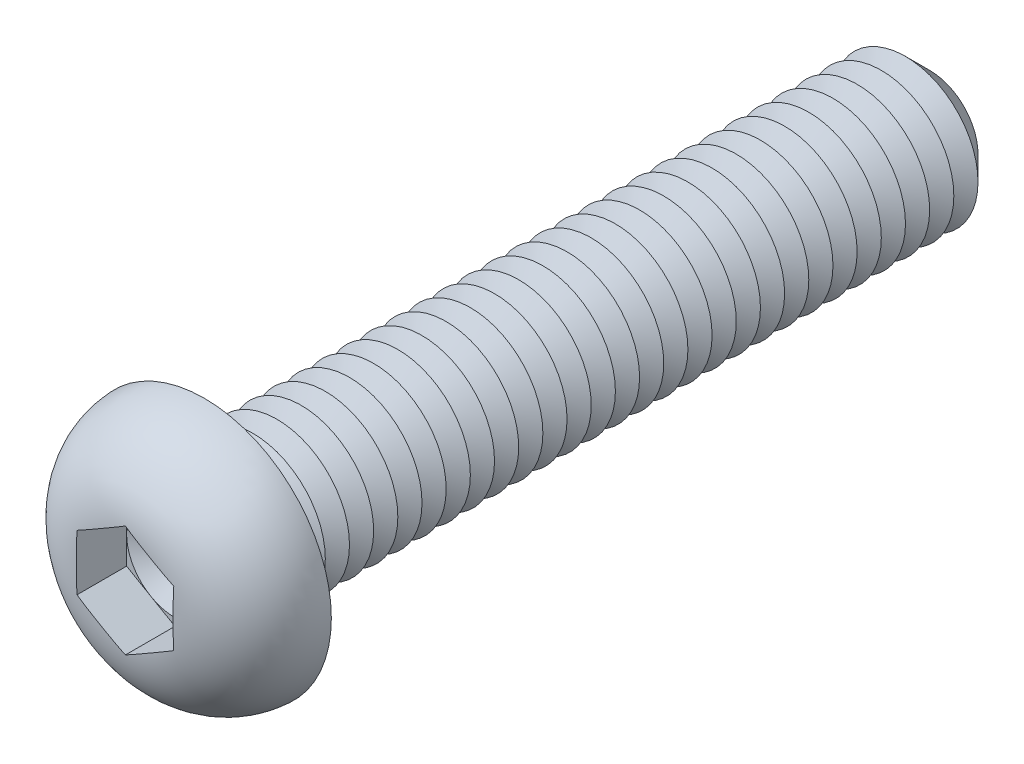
ISO-10303-21;
HEADER;
FILE_DESCRIPTION(('STEP AP214'),'2;1');
FILE_NAME('part.step','',(''),(''),'','','');
FILE_SCHEMA(('AUTOMOTIVE_DESIGN { 1 0 10303 214 1 1 1 1 }'));
ENDSEC;
DATA;
#1=APPLICATION_CONTEXT('core data for automotive mechanical design processes');
#2=APPLICATION_PROTOCOL_DEFINITION('international standard','automotive_design',2000,#1);
#3=PRODUCT_CONTEXT('',#1,'mechanical');
#4=PRODUCT('Part','Part','',(#3));
#5=PRODUCT_RELATED_PRODUCT_CATEGORY('part','',(#4));
#6=PRODUCT_DEFINITION_FORMATION('','',#4);
#7=PRODUCT_DEFINITION_CONTEXT('part definition',#1,'design');
#8=PRODUCT_DEFINITION('design','',#6,#7);
#9=PRODUCT_DEFINITION_SHAPE('','',#8);
#10=(LENGTH_UNIT() NAMED_UNIT(*) SI_UNIT(.MILLI.,.METRE.));
#11=(NAMED_UNIT(*) PLANE_ANGLE_UNIT() SI_UNIT($,.RADIAN.));
#12=(NAMED_UNIT(*) SI_UNIT($,.STERADIAN.) SOLID_ANGLE_UNIT());
#13=UNCERTAINTY_MEASURE_WITH_UNIT(LENGTH_MEASURE(1.E-05),#10,'distance_accuracy_value','');
#14=(GEOMETRIC_REPRESENTATION_CONTEXT(3) GLOBAL_UNCERTAINTY_ASSIGNED_CONTEXT((#13)) GLOBAL_UNIT_ASSIGNED_CONTEXT((#10,
#11,#12)) REPRESENTATION_CONTEXT('',''));
#15=CARTESIAN_POINT('',(0.,0.,0.));
#16=DIRECTION('',(0.,0.,1.));
#17=DIRECTION('',(1.,0.,0.));
#18=AXIS2_PLACEMENT_3D('',#15,#16,#17);
#19=CARTESIAN_POINT('',(0.,0.,1.22));
#20=DIRECTION('',(0.,0.,1.));
#21=DIRECTION('',(1.,0.,0.));
#22=AXIS2_PLACEMENT_3D('',#19,#20,#21);
#23=PLANE('',#22);
#24=CARTESIAN_POINT('',(0.,0.,1.22));
#25=DIRECTION('',(0.,0.,1.));
#26=DIRECTION('',(1.,0.,0.));
#27=AXIS2_PLACEMENT_3D('',#24,#25,#26);
#28=CIRCLE('',#27,2.);
#29=CARTESIAN_POINT('',(2.,0.,1.22));
#30=VERTEX_POINT('',#29);
#31=CARTESIAN_POINT('',(1.,1.73205080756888,1.22));
#32=VERTEX_POINT('',#31);
#33=EDGE_CURVE('E117',#30,#32,#28,.T.);
#34=ORIENTED_EDGE('',*,*,#33,.F.);
#35=DIRECTION('',(0.,1.,0.));
#36=VECTOR('',#35,1.);
#37=CARTESIAN_POINT('',(2.,-1.15470053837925,1.22));
#38=LINE('',#37,#36);
#39=CARTESIAN_POINT('',(2.,1.15470053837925,1.22));
#40=VERTEX_POINT('',#39);
#41=EDGE_CURVE('E140',#30,#40,#38,.T.);
#42=ORIENTED_EDGE('',*,*,#41,.T.);
#43=DIRECTION('',(-0.866025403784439,0.5,0.));
#44=VECTOR('',#43,1.);
#45=CARTESIAN_POINT('',(2.,1.15470053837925,1.22));
#46=LINE('',#45,#44);
#47=EDGE_CURVE('E136',#40,#32,#46,.T.);
#48=ORIENTED_EDGE('',*,*,#47,.T.);
#49=EDGE_LOOP('',(#34,#42,#48));
#50=FACE_BOUND('',#49,.T.);
#51=ADVANCED_FACE('F39',(#50),#23,.T.);
#52=CARTESIAN_POINT('',(0.,0.,1.22));
#53=DIRECTION('',(0.,0.,1.));
#54=DIRECTION('',(1.,0.,0.));
#55=AXIS2_PLACEMENT_3D('',#52,#53,#54);
#56=CIRCLE('',#55,2.);
#57=CARTESIAN_POINT('',(-1.,1.73205080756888,1.22));
#58=VERTEX_POINT('',#57);
#59=EDGE_CURVE('E11',#32,#58,#56,.T.);
#60=ORIENTED_EDGE('',*,*,#59,.F.);
#61=CARTESIAN_POINT('',(0.,2.3094010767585,1.22));
#62=VERTEX_POINT('',#61);
#63=EDGE_CURVE('E130',#32,#62,#46,.T.);
#64=ORIENTED_EDGE('',*,*,#63,.T.);
#65=DIRECTION('',(-0.866025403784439,-0.5,0.));
#66=VECTOR('',#65,1.);
#67=CARTESIAN_POINT('',(0.,2.3094010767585,1.22));
#68=LINE('',#67,#66);
#69=EDGE_CURVE('E131',#62,#58,#68,.T.);
#70=ORIENTED_EDGE('',*,*,#69,.T.);
#71=EDGE_LOOP('',(#60,#64,#70));
#72=FACE_BOUND('',#71,.T.);
#73=ADVANCED_FACE('F129',(#72),#23,.T.);
#74=CARTESIAN_POINT('',(-2.,0.,1.22));
#75=VERTEX_POINT('',#74);
#76=EDGE_CURVE('E49',#58,#75,#56,.T.);
#77=ORIENTED_EDGE('',*,*,#76,.F.);
#78=CARTESIAN_POINT('',(-2.,1.15470053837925,1.22));
#79=VERTEX_POINT('',#78);
#80=EDGE_CURVE('E143',#58,#79,#68,.T.);
#81=ORIENTED_EDGE('',*,*,#80,.T.);
#82=DIRECTION('',(0.,-1.,0.));
#83=VECTOR('',#82,1.);
#84=CARTESIAN_POINT('',(-2.,1.15470053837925,1.22));
#85=LINE('',#84,#83);
#86=EDGE_CURVE('E152',#79,#75,#85,.T.);
#87=ORIENTED_EDGE('',*,*,#86,.T.);
#88=EDGE_LOOP('',(#77,#81,#87));
#89=FACE_BOUND('',#88,.T.);
#90=ADVANCED_FACE('F272',(#89),#23,.T.);
#91=CARTESIAN_POINT('',(-1.,-1.73205080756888,1.22));
#92=VERTEX_POINT('',#91);
#93=EDGE_CURVE('E254',#75,#92,#56,.T.);
#94=ORIENTED_EDGE('',*,*,#93,.F.);
#95=CARTESIAN_POINT('',(-2.,-1.15470053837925,1.22));
#96=VERTEX_POINT('',#95);
#97=EDGE_CURVE('E151',#75,#96,#85,.T.);
#98=ORIENTED_EDGE('',*,*,#97,.T.);
#99=DIRECTION('',(0.866025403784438,-0.5,0.));
#100=VECTOR('',#99,1.);
#101=CARTESIAN_POINT('',(-2.,-1.15470053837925,1.22));
#102=LINE('',#101,#100);
#103=EDGE_CURVE('E157',#96,#92,#102,.T.);
#104=ORIENTED_EDGE('',*,*,#103,.T.);
#105=EDGE_LOOP('',(#94,#98,#104));
#106=FACE_BOUND('',#105,.T.);
#107=ADVANCED_FACE('F266',(#106),#23,.T.);
#108=CARTESIAN_POINT('',(0.999999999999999,-1.73205080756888,1.22));
#109=VERTEX_POINT('',#108);
#110=EDGE_CURVE('E56',#92,#109,#56,.T.);
#111=ORIENTED_EDGE('',*,*,#110,.F.);
#112=CARTESIAN_POINT('',(0.,-2.3094010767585,1.22));
#113=VERTEX_POINT('',#112);
#114=EDGE_CURVE('E156',#92,#113,#102,.T.);
#115=ORIENTED_EDGE('',*,*,#114,.T.);
#116=DIRECTION('',(0.866025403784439,0.5,0.));
#117=VECTOR('',#116,1.);
#118=CARTESIAN_POINT('',(0.,-2.3094010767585,1.22));
#119=LINE('',#118,#117);
#120=EDGE_CURVE('E162',#113,#109,#119,.T.);
#121=ORIENTED_EDGE('',*,*,#120,.T.);
#122=EDGE_LOOP('',(#111,#115,#121));
#123=FACE_BOUND('',#122,.T.);
#124=ADVANCED_FACE('F308',(#123),#23,.T.);
#125=CARTESIAN_POINT('',(0.,0.,-30.));
#126=DIRECTION('',(0.,0.,1.));
#127=DIRECTION('',(1.,0.,0.));
#128=AXIS2_PLACEMENT_3D('',#125,#126,#127);
#129=CYLINDRICAL_SURFACE('',#128,3.);
#130=CARTESIAN_POINT('',(0.,0.,-0.5));
#131=DIRECTION('',(0.,0.,1.));
#132=DIRECTION('',(1.,0.,0.));
#133=AXIS2_PLACEMENT_3D('',#130,#131,#132);
#134=CIRCLE('',#133,3.);
#135=CARTESIAN_POINT('',(3.,0.,-0.5));
#136=VERTEX_POINT('',#135);
#137=EDGE_CURVE('E241',#136,#136,#134,.F.);
#138=ORIENTED_EDGE('',*,*,#137,.T.);
#139=EDGE_LOOP('',(#138));
#140=FACE_BOUND('',#139,.T.);
#141=CARTESIAN_POINT('',(0.,0.,-1.));
#142=DIRECTION('',(0.,0.,1.));
#143=DIRECTION('',(1.,0.,0.));
#144=AXIS2_PLACEMENT_3D('',#141,#142,#143);
#145=CIRCLE('',#144,3.00000000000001);
#146=CARTESIAN_POINT('',(3.00000000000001,0.,-1.));
#147=VERTEX_POINT('',#146);
#148=EDGE_CURVE('E138',#147,#147,#145,.T.);
#149=ORIENTED_EDGE('',*,*,#148,.T.);
#150=EDGE_LOOP('',(#149));
#151=FACE_BOUND('',#150,.T.);
#152=ADVANCED_FACE('F309',(#140,#151),#129,.T.);
#153=CARTESIAN_POINT('',(0.,5.25,0.));
#154=DIRECTION('',(0.,0.,1.));
#155=DIRECTION('',(1.,0.,0.));
#156=AXIS2_PLACEMENT_3D('',#153,#154,#155);
#157=PLANE('',#156);
#158=CARTESIAN_POINT('',(0.,0.,0.));
#159=DIRECTION('',(0.,0.,1.));
#160=DIRECTION('',(1.,0.,0.));
#161=AXIS2_PLACEMENT_3D('',#158,#159,#160);
#162=CIRCLE('',#161,3.5);
#163=CARTESIAN_POINT('',(3.5,0.,0.));
#164=VERTEX_POINT('',#163);
#165=EDGE_CURVE('E244',#164,#164,#162,.T.);
#166=ORIENTED_EDGE('',*,*,#165,.T.);
#167=EDGE_LOOP('',(#166));
#168=FACE_BOUND('',#167,.T.);
#169=CARTESIAN_POINT('',(0.,0.,0.));
#170=DIRECTION('',(0.,0.,1.));
#171=DIRECTION('',(1.,0.,0.));
#172=AXIS2_PLACEMENT_3D('',#169,#170,#171);
#173=CIRCLE('',#172,5.25);
#174=CARTESIAN_POINT('',(5.25,0.,0.));
#175=VERTEX_POINT('',#174);
#176=EDGE_CURVE('E173',#175,#175,#173,.T.);
#177=ORIENTED_EDGE('',*,*,#176,.F.);
#178=EDGE_LOOP('',(#177));
#179=FACE_BOUND('',#178,.T.);
#180=ADVANCED_FACE('F312',(#168,#179),#157,.F.);
#181=CARTESIAN_POINT('',(0.,0.,-0.0999999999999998));
#182=DIRECTION('',(0.,0.,1.));
#183=DIRECTION('',(1.,0.,0.));
#184=AXIS2_PLACEMENT_3D('',#181,#182,#183);
#185=DEGENERATE_TOROIDAL_SURFACE('',#184,1.85147090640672,3.4,.T.);
#186=CARTESIAN_POINT('',(-2.0002,1.15458506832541,3.26900492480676));
#187=CARTESIAN_POINT('',(-1.91694658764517,1.20265144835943,3.27552708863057));
#188=CARTESIAN_POINT('',(-1.83362001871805,1.25076006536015,3.28041849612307));
#189=CARTESIAN_POINT('',(-1.66691146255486,1.34700929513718,3.28784569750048));
#190=CARTESIAN_POINT('',(-1.58352950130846,1.39514989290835,3.29038223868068));
#191=CARTESIAN_POINT('',(-1.4167967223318,1.49141310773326,3.29400753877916));
#192=CARTESIAN_POINT('',(-1.33344591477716,1.5395357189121,3.29509714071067));
#193=CARTESIAN_POINT('',(-1.16673007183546,1.63578915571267,3.29647051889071));
#194=CARTESIAN_POINT('',(-1.08336503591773,1.68391998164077,3.29675420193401));
#195=CARTESIAN_POINT('',(-0.916634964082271,1.78018163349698,3.29675420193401));
#196=CARTESIAN_POINT('',(-0.833269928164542,1.82831245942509,3.29647051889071));
#197=CARTESIAN_POINT('',(-0.666554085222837,1.92456589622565,3.29509714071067));
#198=CARTESIAN_POINT('',(-0.583203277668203,1.9726885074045,3.29400753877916));
#199=CARTESIAN_POINT('',(-0.416470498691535,2.06895172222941,3.29038223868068));
#200=CARTESIAN_POINT('',(-0.333088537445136,2.11709232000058,3.28784569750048));
#201=CARTESIAN_POINT('',(-0.166379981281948,2.21334154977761,3.28041849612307));
#202=CARTESIAN_POINT('',(-0.0830534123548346,2.26145016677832,3.27552708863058));
#203=CARTESIAN_POINT('',(0.000200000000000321,2.30951654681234,3.26900492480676));
#204=B_SPLINE_CURVE_WITH_KNOTS('',3,(#186,#187,#188,#189,#190,#191,#192,#193,#194,#195,#196,
#197,#198,#199,#200,#201,#202,#203),.UNSPECIFIED.,.F.,.F.,(4,2,2,2,2,2,2,2,4),(0.,
0.289010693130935,0.57792963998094,0.866680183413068,1.15546411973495,1.44424805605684,
1.73299859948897,2.02191754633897,2.31092823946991),.UNSPECIFIED.);
#205=CARTESIAN_POINT('',(-2.,1.15470053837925,3.26902062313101));
#206=VERTEX_POINT('',#205);
#207=CARTESIAN_POINT('',(1.70733705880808E-11,2.30940107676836,3.2690206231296));
#208=VERTEX_POINT('',#207);
#209=EDGE_CURVE('E195',#206,#208,#204,.T.);
#210=ORIENTED_EDGE('',*,*,#209,.T.);
#211=CARTESIAN_POINT('',(-0.000199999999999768,2.30951654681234,3.26900492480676));
#212=CARTESIAN_POINT('',(0.0830534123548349,2.26145016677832,3.27552708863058));
#213=CARTESIAN_POINT('',(0.166379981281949,2.21334154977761,3.28041849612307));
#214=CARTESIAN_POINT('',(0.333088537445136,2.11709232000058,3.28784569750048));
#215=CARTESIAN_POINT('',(0.416470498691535,2.06895172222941,3.29038223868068));
#216=CARTESIAN_POINT('',(0.583203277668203,1.9726885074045,3.29400753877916));
#217=CARTESIAN_POINT('',(0.666554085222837,1.92456589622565,3.29509714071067));
#218=CARTESIAN_POINT('',(0.833269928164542,1.82831245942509,3.29647051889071));
#219=CARTESIAN_POINT('',(0.916634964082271,1.78018163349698,3.29675420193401));
#220=CARTESIAN_POINT('',(1.08336503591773,1.68391998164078,3.29675420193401));
#221=CARTESIAN_POINT('',(1.16673007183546,1.63578915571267,3.29647051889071));
#222=CARTESIAN_POINT('',(1.33344591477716,1.5395357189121,3.29509714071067));
#223=CARTESIAN_POINT('',(1.4167967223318,1.49141310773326,3.29400753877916));
#224=CARTESIAN_POINT('',(1.58352950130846,1.39514989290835,3.29038223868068));
#225=CARTESIAN_POINT('',(1.66691146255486,1.34700929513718,3.28784569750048));
#226=CARTESIAN_POINT('',(1.83362001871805,1.25076006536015,3.28041849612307));
#227=CARTESIAN_POINT('',(1.91694658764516,1.20265144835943,3.27552708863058));
#228=CARTESIAN_POINT('',(2.0002,1.15458506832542,3.26900492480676));
#229=B_SPLINE_CURVE_WITH_KNOTS('',3,(#211,#212,#213,#214,#215,#216,#217,#218,#219,#220,#221,
#222,#223,#224,#225,#226,#227,#228),.UNSPECIFIED.,.F.,.F.,(4,2,2,2,2,2,2,2,4),(0.,
0.289010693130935,0.577929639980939,0.866680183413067,1.15546411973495,1.44424805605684,
1.73299859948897,2.02191754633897,2.31092823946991),.UNSPECIFIED.);
#230=CARTESIAN_POINT('',(2.,1.15470053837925,3.26902062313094));
#231=VERTEX_POINT('',#230);
#232=EDGE_CURVE('E224',#208,#231,#229,.T.);
#233=ORIENTED_EDGE('',*,*,#232,.T.);
#234=CARTESIAN_POINT('',(2.,0.,3.29675420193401));
#235=CARTESIAN_POINT('',(2.,-0.0838690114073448,3.29675159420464));
#236=CARTESIAN_POINT('',(2.,-0.167737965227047,3.29653427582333));
#237=CARTESIAN_POINT('',(2.,-0.335473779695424,3.29552217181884));
#238=CARTESIAN_POINT('',(2.,-0.419340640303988,3.29472737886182));
#239=CARTESIAN_POINT('',(2.,-0.587092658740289,3.29218243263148));
#240=CARTESIAN_POINT('',(2.,-0.670977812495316,3.29043194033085));
#241=CARTESIAN_POINT('',(2.,-0.838702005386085,3.28542814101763));
#242=CARTESIAN_POINT('',(2.,-0.922541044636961,3.28217483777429));
#243=CARTESIAN_POINT('',(2.,-1.173343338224,3.26923984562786));
#244=CARTESIAN_POINT('',(2.,-1.34017699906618,3.25638268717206));
#245=CARTESIAN_POINT('',(2.,-1.67225876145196,3.21731215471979));
#246=CARTESIAN_POINT('',(2.,-1.83750825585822,3.19111187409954));
#247=CARTESIAN_POINT('',(2.,-2.10571503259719,3.13417573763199));
#248=CARTESIAN_POINT('',(2.,-2.20973442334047,3.10844622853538));
#249=CARTESIAN_POINT('',(2.,-2.41562153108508,3.04936015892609));
#250=CARTESIAN_POINT('',(2.,-2.51748898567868,3.01600267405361));
#251=CARTESIAN_POINT('',(2.,-2.71832295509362,2.94120377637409));
#252=CARTESIAN_POINT('',(2.,-2.81728700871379,2.89975572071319));
#253=CARTESIAN_POINT('',(2.,-3.01134256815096,2.80859624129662));
#254=CARTESIAN_POINT('',(2.,-3.10643425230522,2.75888519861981));
#255=CARTESIAN_POINT('',(2.,-3.29253530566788,2.65079509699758));
#256=CARTESIAN_POINT('',(2.,-3.38350832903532,2.59235327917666));
#257=CARTESIAN_POINT('',(2.,-3.55964478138,2.46728791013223));
#258=CARTESIAN_POINT('',(2.,-3.64480873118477,2.40066509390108));
#259=CARTESIAN_POINT('',(2.,-3.80840353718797,2.25961603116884));
#260=CARTESIAN_POINT('',(2.,-3.88683504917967,2.18519054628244));
#261=CARTESIAN_POINT('',(2.,-4.03608847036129,2.02906828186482));
#262=CARTESIAN_POINT('',(2.,-4.106911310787,1.94737239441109));
#263=CARTESIAN_POINT('',(2.,-4.23287471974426,1.78665318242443));
#264=CARTESIAN_POINT('',(2.,-4.2888832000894,1.7083085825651));
#265=CARTESIAN_POINT('',(2.,-4.39372062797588,1.54691061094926));
#266=CARTESIAN_POINT('',(2.,-4.44254705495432,1.46385560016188));
#267=CARTESIAN_POINT('',(2.,-4.53249771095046,1.29375158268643));
#268=CARTESIAN_POINT('',(2.,-4.57362814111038,1.20670586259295));
#269=CARTESIAN_POINT('',(2.,-4.6478549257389,1.02924414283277));
#270=CARTESIAN_POINT('',(2.,-4.68094842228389,0.938826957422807));
#271=CARTESIAN_POINT('',(2.,-4.76413649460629,0.674747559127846));
#272=CARTESIAN_POINT('',(2.,-4.80368573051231,0.497625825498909));
#273=CARTESIAN_POINT('',(2.,-4.85179982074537,0.13932226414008));
#274=CARTESIAN_POINT('',(2.,-4.86036774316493,-0.0418591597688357));
#275=CARTESIAN_POINT('',(2.,-4.84642577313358,-0.399473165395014));
#276=CARTESIAN_POINT('',(2.,-4.82452156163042,-0.575929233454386));
#277=CARTESIAN_POINT('',(2.,-4.75142809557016,-0.922615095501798));
#278=CARTESIAN_POINT('',(2.,-4.70024536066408,-1.09284626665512));
#279=CARTESIAN_POINT('',(2.,-4.57020203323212,-1.42258491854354));
#280=CARTESIAN_POINT('',(2.,-4.49131097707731,-1.58208036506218));
#281=CARTESIAN_POINT('',(2.,-4.3083542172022,-1.8860021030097));
#282=CARTESIAN_POINT('',(2.,-4.2042742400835,-2.03041978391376));
#283=CARTESIAN_POINT('',(2.,-3.97174533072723,-2.30354399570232));
#284=CARTESIAN_POINT('',(2.,-3.84281347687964,-2.43183812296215));
#285=CARTESIAN_POINT('',(2.,-3.56631740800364,-2.66612298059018));
#286=CARTESIAN_POINT('',(2.,-3.41877418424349,-2.77213848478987));
#287=CARTESIAN_POINT('',(2.,-3.18261597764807,-2.91604941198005));
#288=CARTESIAN_POINT('',(2.,-3.09905663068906,-2.96247915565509));
#289=CARTESIAN_POINT('',(2.,-2.92856838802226,-3.04879370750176));
#290=CARTESIAN_POINT('',(2.,-2.84163827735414,-3.08867612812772));
#291=CARTESIAN_POINT('',(2.,-2.66495003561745,-3.16199567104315));
#292=CARTESIAN_POINT('',(2.,-2.57518752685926,-3.19542218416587));
#293=CARTESIAN_POINT('',(2.,-2.3936698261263,-3.25594506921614));
#294=CARTESIAN_POINT('',(2.,-2.30191676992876,-3.28304789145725));
#295=CARTESIAN_POINT('',(2.,-2.07265810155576,-3.34285611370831));
#296=CARTESIAN_POINT('',(2.,-1.93423373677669,-3.37205334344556));
#297=CARTESIAN_POINT('',(2.,-1.65546420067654,-3.419280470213));
#298=CARTESIAN_POINT('',(2.,-1.51511762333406,-3.43730169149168));
#299=CARTESIAN_POINT('',(2.,-1.23291689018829,-3.46473877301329));
#300=CARTESIAN_POINT('',(2.,-1.09105869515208,-3.47411015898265));
#301=CARTESIAN_POINT('',(2.,-0.807138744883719,-3.48717303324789));
#302=CARTESIAN_POINT('',(2.,-0.665077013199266,-3.4908651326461));
#303=CARTESIAN_POINT('',(2.,-0.451303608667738,-3.49429675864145));
#304=CARTESIAN_POINT('',(2.,-0.379602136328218,-3.49508825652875));
#305=CARTESIAN_POINT('',(2.,-0.236195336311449,-3.49619580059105));
#306=CARTESIAN_POINT('',(2.,-0.164490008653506,-3.49651184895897));
#307=CARTESIAN_POINT('',(2.,-0.0210718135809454,-3.49680708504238));
#308=CARTESIAN_POINT('',(2.,0.0506410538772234,-3.49678623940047));
#309=CARTESIAN_POINT('',(2.,0.194065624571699,-3.49639104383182));
#310=CARTESIAN_POINT('',(2.,0.265777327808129,-3.49601669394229));
#311=CARTESIAN_POINT('',(2.,0.480501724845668,-3.4941697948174));
#312=CARTESIAN_POINT('',(2.,0.623510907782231,-3.49197539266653));
#313=CARTESIAN_POINT('',(2.,0.909378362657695,-3.48318258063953));
#314=CARTESIAN_POINT('',(2.,1.05223667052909,-3.47658576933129));
#315=CARTESIAN_POINT('',(2.,1.30726724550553,-3.45800282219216));
#316=CARTESIAN_POINT('',(2.,1.41953767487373,-3.44745204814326));
#317=CARTESIAN_POINT('',(2.,1.64336701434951,-3.42020385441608));
#318=CARTESIAN_POINT('',(2.,1.75492585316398,-3.40350582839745));
#319=CARTESIAN_POINT('',(2.,1.97590795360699,-3.36293007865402));
#320=CARTESIAN_POINT('',(2.,2.08534088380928,-3.33910600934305));
#321=CARTESIAN_POINT('',(2.,2.30216001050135,-3.28336687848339));
#322=CARTESIAN_POINT('',(2.,2.40954602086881,-3.25145108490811));
#323=CARTESIAN_POINT('',(2.,2.62289868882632,-3.1784271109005));
#324=CARTESIAN_POINT('',(2.,2.72882262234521,-3.13719314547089));
#325=CARTESIAN_POINT('',(2.,2.93660837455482,-3.04548652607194));
#326=CARTESIAN_POINT('',(2.,3.03847031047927,-2.99501413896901));
#327=CARTESIAN_POINT('',(2.,3.23738754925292,-2.88459171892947));
#328=CARTESIAN_POINT('',(2.,3.33442546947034,-2.82461027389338));
#329=CARTESIAN_POINT('',(2.,3.52225616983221,-2.69545434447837));
#330=CARTESIAN_POINT('',(2.,3.61304636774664,-2.62627609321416));
#331=CARTESIAN_POINT('',(2.,3.77958578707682,-2.48563135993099));
#332=CARTESIAN_POINT('',(2.,3.85595570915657,-2.41489922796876));
#333=CARTESIAN_POINT('',(2.,4.00175744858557,-2.26661746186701));
#334=CARTESIAN_POINT('',(2.,4.07118992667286,-2.18906847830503));
#335=CARTESIAN_POINT('',(2.,4.20228235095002,-2.02784942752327));
#336=CARTESIAN_POINT('',(2.,4.26395450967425,-1.94418931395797));
#337=CARTESIAN_POINT('',(2.,4.37897455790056,-1.7713710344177));
#338=CARTESIAN_POINT('',(2.,4.43232318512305,-1.68221335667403));
#339=CARTESIAN_POINT('',(2.,4.5685109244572,-1.42722170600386));
#340=CARTESIAN_POINT('',(2.,4.64167742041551,-1.25607726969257));
#341=CARTESIAN_POINT('',(2.,4.75695354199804,-0.903699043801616));
#342=CARTESIAN_POINT('',(2.,4.79906366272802,-0.722465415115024));
#343=CARTESIAN_POINT('',(2.,4.84982785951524,-0.362243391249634));
#344=CARTESIAN_POINT('',(2.,4.85966759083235,-0.183422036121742));
#345=CARTESIAN_POINT('',(2.,4.84889099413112,0.17327689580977));
#346=CARTESIAN_POINT('',(2.,4.82827907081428,0.351154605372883));
#347=CARTESIAN_POINT('',(2.,4.75760776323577,0.699332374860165));
#348=CARTESIAN_POINT('',(2.,4.70780624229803,0.869684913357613));
#349=CARTESIAN_POINT('',(2.,4.58058971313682,1.199716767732));
#350=CARTESIAN_POINT('',(2.,4.50317623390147,1.35939667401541));
#351=CARTESIAN_POINT('',(2.,4.32230037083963,1.66542907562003));
#352=CARTESIAN_POINT('',(2.,4.21858077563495,1.81162931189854));
#353=CARTESIAN_POINT('',(2.,3.98879583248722,2.08527000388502));
#354=CARTESIAN_POINT('',(2.,3.86272429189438,2.21270524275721));
#355=CARTESIAN_POINT('',(2.,3.58743550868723,2.45020985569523));
#356=CARTESIAN_POINT('',(2.,3.43756474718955,2.55951924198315));
#357=CARTESIAN_POINT('',(2.,3.12282273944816,2.7535430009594));
#358=CARTESIAN_POINT('',(2.,2.95795742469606,2.83826704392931));
#359=CARTESIAN_POINT('',(2.,2.67096435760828,2.96064273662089));
#360=CARTESIAN_POINT('',(2.,2.55150855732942,3.00473766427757));
#361=CARTESIAN_POINT('',(2.,2.30905936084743,3.08191633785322));
#362=CARTESIAN_POINT('',(2.,2.18606487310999,3.11499664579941));
#363=CARTESIAN_POINT('',(2.,1.93761764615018,3.17114962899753));
#364=CARTESIAN_POINT('',(2.,1.8121607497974,3.19420352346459));
#365=CARTESIAN_POINT('',(2.,1.56000755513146,3.23170431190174));
#366=CARTESIAN_POINT('',(2.,1.43331126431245,3.24615125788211));
#367=CARTESIAN_POINT('',(2.,1.19785080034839,3.26676473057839));
#368=CARTESIAN_POINT('',(2.,1.08915974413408,3.27383022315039));
#369=CARTESIAN_POINT('',(2.,0.87159878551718,3.28448481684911));
#370=CARTESIAN_POINT('',(2.,0.762728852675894,3.28807324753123));
#371=CARTESIAN_POINT('',(2.,0.54488171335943,3.29312180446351));
#372=CARTESIAN_POINT('',(2.,0.435904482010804,3.29458062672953));
#373=CARTESIAN_POINT('',(2.,0.217951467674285,3.29639847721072));
#374=CARTESIAN_POINT('',(2.,0.108975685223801,3.29675759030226));
#375=CARTESIAN_POINT('',(2.,0.,3.29675420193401));
#376=B_SPLINE_CURVE_WITH_KNOTS('',3,(#234,#235,#236,#237,#238,#239,#240,#241,#242,#243,#244,
#245,#246,#247,#248,#249,#250,#251,#252,#253,#254,#255,#256,#257,#258,#259,#260,#261,#262,#263,
#264,#265,#266,#267,#268,#269,#270,#271,#272,#273,#274,#275,#276,#277,#278,#279,#280,#281,#282,
#283,#284,#285,#286,#287,#288,#289,#290,#291,#292,#293,#294,#295,#296,#297,#298,#299,#300,#301,
#302,#303,#304,#305,#306,#307,#308,#309,#310,#311,#312,#313,#314,#315,#316,#317,#318,#319,#320,
#321,#322,#323,#324,#325,#326,#327,#328,#329,#330,#331,#332,#333,#334,#335,#336,#337,#338,#339,
#340,#341,#342,#343,#344,#345,#346,#347,#348,#349,#350,#351,#352,#353,#354,#355,#356,#357,#358,
#359,#360,#361,#362,#363,#364,#365,#366,#367,#368,#369,#370,#371,#372,#373,#374,#375),
.UNSPECIFIED.,.T.,.F.,(4,2,2,2,2,2,2,2,2,2,2,2,2,2,2,2,2,2,2,2,2,2,2,2,2,2,2,2,2,2,2,2,2,2,2,2,
2,2,2,2,2,2,2,2,2,2,2,2,2,2,2,2,2,2,2,2,2,2,2,2,2,2,2,2,2,2,2,2,2,2,4),(0.,0.251606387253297,
0.503215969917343,0.754914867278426,1.00661313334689,1.50825543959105,2.00940643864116,
2.33061510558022,2.65186271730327,2.97337521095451,3.29487288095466,3.61880390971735,
3.94270585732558,4.26657621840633,4.59040689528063,4.8789527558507,5.16759964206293,
5.45601293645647,5.74452864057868,6.28608750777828,6.82759274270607,7.35848716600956,
7.8892634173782,8.42062506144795,8.95228851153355,9.49557283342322,10.0382497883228,
10.3247866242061,10.6114277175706,10.8985359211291,11.1853499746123,11.6091713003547,
12.0333212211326,12.4596400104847,12.8859129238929,13.1010304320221,13.316146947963,
13.5312847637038,13.746422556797,14.1754765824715,14.6043748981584,14.9425387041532,
15.2807358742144,15.6164481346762,15.9521907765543,16.2927694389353,16.6333382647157,
16.9750565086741,17.3169151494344,17.6287548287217,17.9405647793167,18.2518777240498,
18.5631630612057,19.1185081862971,19.6738444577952,20.20853386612,20.7431459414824,
21.2731049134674,21.8030345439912,22.3383600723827,22.8738341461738,23.4279697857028,
23.9818871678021,24.3633752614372,24.7449823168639,25.1273011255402,25.5096176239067,
25.8363061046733,26.163057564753,26.4900090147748,26.8169352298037),.UNSPECIFIED.);
#377=CARTESIAN_POINT('',(2.,-1.15470053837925,3.26902062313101));
#378=VERTEX_POINT('',#377);
#379=EDGE_CURVE('E233',#231,#378,#376,.T.);
#380=ORIENTED_EDGE('',*,*,#379,.T.);
#381=CARTESIAN_POINT('',(2.0002,-1.15458506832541,3.26900492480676));
#382=CARTESIAN_POINT('',(1.91694658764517,-1.20265144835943,3.27552708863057));
#383=CARTESIAN_POINT('',(1.83362001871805,-1.25076006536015,3.28041849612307));
#384=CARTESIAN_POINT('',(1.66691146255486,-1.34700929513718,3.28784569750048));
#385=CARTESIAN_POINT('',(1.58352950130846,-1.39514989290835,3.29038223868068));
#386=CARTESIAN_POINT('',(1.4167967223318,-1.49141310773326,3.29400753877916));
#387=CARTESIAN_POINT('',(1.33344591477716,-1.5395357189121,3.29509714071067));
#388=CARTESIAN_POINT('',(1.16673007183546,-1.63578915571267,3.29647051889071));
#389=CARTESIAN_POINT('',(1.08336503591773,-1.68391998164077,3.29675420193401));
#390=CARTESIAN_POINT('',(0.916634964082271,-1.78018163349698,3.29675420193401));
#391=CARTESIAN_POINT('',(0.833269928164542,-1.82831245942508,3.29647051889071));
#392=CARTESIAN_POINT('',(0.666554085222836,-1.92456589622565,3.29509714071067));
#393=CARTESIAN_POINT('',(0.583203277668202,-1.97268850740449,3.29400753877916));
#394=CARTESIAN_POINT('',(0.416470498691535,-2.06895172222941,3.29038223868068));
#395=CARTESIAN_POINT('',(0.333088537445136,-2.11709232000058,3.28784569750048));
#396=CARTESIAN_POINT('',(0.166379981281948,-2.2133415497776,3.28041849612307));
#397=CARTESIAN_POINT('',(0.0830534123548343,-2.26145016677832,3.27552708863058));
#398=CARTESIAN_POINT('',(-0.000200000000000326,-2.30951654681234,3.26900492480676));
#399=B_SPLINE_CURVE_WITH_KNOTS('',3,(#381,#382,#383,#384,#385,#386,#387,#388,#389,#390,#391,
#392,#393,#394,#395,#396,#397,#398),.UNSPECIFIED.,.F.,.F.,(4,2,2,2,2,2,2,2,4),(0.,
0.289010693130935,0.57792963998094,0.866680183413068,1.15546411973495,1.44424805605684,
1.73299859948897,2.02191754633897,2.31092823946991),.UNSPECIFIED.);
#400=CARTESIAN_POINT('',(0.,-2.3094010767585,3.26902062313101));
#401=VERTEX_POINT('',#400);
#402=EDGE_CURVE('E282',#378,#401,#399,.T.);
#403=ORIENTED_EDGE('',*,*,#402,.T.);
#404=CARTESIAN_POINT('',(0.000199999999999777,-2.30951654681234,3.26900492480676));
#405=CARTESIAN_POINT('',(-0.083053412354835,-2.26145016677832,3.27552708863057));
#406=CARTESIAN_POINT('',(-0.166379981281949,-2.21334154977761,3.28041849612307));
#407=CARTESIAN_POINT('',(-0.333088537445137,-2.11709232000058,3.28784569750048));
#408=CARTESIAN_POINT('',(-0.416470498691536,-2.06895172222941,3.29038223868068));
#409=CARTESIAN_POINT('',(-0.583203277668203,-1.97268850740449,3.29400753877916));
#410=CARTESIAN_POINT('',(-0.666554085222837,-1.92456589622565,3.29509714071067));
#411=CARTESIAN_POINT('',(-0.833269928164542,-1.82831245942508,3.29647051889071));
#412=CARTESIAN_POINT('',(-0.916634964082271,-1.78018163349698,3.29675420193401));
#413=CARTESIAN_POINT('',(-1.08336503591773,-1.68391998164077,3.29675420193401));
#414=CARTESIAN_POINT('',(-1.16673007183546,-1.63578915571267,3.29647051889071));
#415=CARTESIAN_POINT('',(-1.33344591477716,-1.5395357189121,3.29509714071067));
#416=CARTESIAN_POINT('',(-1.4167967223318,-1.49141310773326,3.29400753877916));
#417=CARTESIAN_POINT('',(-1.58352950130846,-1.39514989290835,3.29038223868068));
#418=CARTESIAN_POINT('',(-1.66691146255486,-1.34700929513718,3.28784569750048));
#419=CARTESIAN_POINT('',(-1.83362001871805,-1.25076006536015,3.28041849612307));
#420=CARTESIAN_POINT('',(-1.91694658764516,-1.20265144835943,3.27552708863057));
#421=CARTESIAN_POINT('',(-2.0002,-1.15458506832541,3.26900492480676));
#422=B_SPLINE_CURVE_WITH_KNOTS('',3,(#404,#405,#406,#407,#408,#409,#410,#411,#412,#413,#414,
#415,#416,#417,#418,#419,#420,#421),.UNSPECIFIED.,.F.,.F.,(4,2,2,2,2,2,2,2,4),(0.,
0.289010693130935,0.577929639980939,0.866680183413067,1.15546411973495,1.44424805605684,
1.73299859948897,2.02191754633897,2.31092823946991),.UNSPECIFIED.);
#423=CARTESIAN_POINT('',(-2.,-1.15470053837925,3.26902062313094));
#424=VERTEX_POINT('',#423);
#425=EDGE_CURVE('E279',#401,#424,#422,.T.);
#426=ORIENTED_EDGE('',*,*,#425,.T.);
#427=CARTESIAN_POINT('',(-2.,0.,3.29675420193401));
#428=CARTESIAN_POINT('',(-2.,0.0838690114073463,3.29675159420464));
#429=CARTESIAN_POINT('',(-2.,0.167737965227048,3.29653427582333));
#430=CARTESIAN_POINT('',(-2.,0.335473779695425,3.29552217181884));
#431=CARTESIAN_POINT('',(-2.,0.41934064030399,3.29472737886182));
#432=CARTESIAN_POINT('',(-2.,0.58709265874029,3.29218243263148));
#433=CARTESIAN_POINT('',(-2.,0.670977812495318,3.29043194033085));
#434=CARTESIAN_POINT('',(-2.,0.838702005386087,3.28542814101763));
#435=CARTESIAN_POINT('',(-2.,0.922541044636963,3.28217483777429));
#436=CARTESIAN_POINT('',(-2.,1.173343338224,3.26923984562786));
#437=CARTESIAN_POINT('',(-2.,1.34017699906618,3.25638268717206));
#438=CARTESIAN_POINT('',(-2.,1.67225876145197,3.21731215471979));
#439=CARTESIAN_POINT('',(-2.,1.83750825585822,3.19111187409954));
#440=CARTESIAN_POINT('',(-2.,2.10571503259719,3.13417573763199));
#441=CARTESIAN_POINT('',(-2.,2.20973442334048,3.10844622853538));
#442=CARTESIAN_POINT('',(-2.,2.41562153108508,3.04936015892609));
#443=CARTESIAN_POINT('',(-2.,2.51748898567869,3.01600267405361));
#444=CARTESIAN_POINT('',(-2.,2.71832295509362,2.94120377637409));
#445=CARTESIAN_POINT('',(-2.,2.81728700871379,2.89975572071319));
#446=CARTESIAN_POINT('',(-2.,3.01134256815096,2.80859624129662));
#447=CARTESIAN_POINT('',(-2.,3.10643425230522,2.75888519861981));
#448=CARTESIAN_POINT('',(-2.,3.29253530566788,2.65079509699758));
#449=CARTESIAN_POINT('',(-2.,3.38350832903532,2.59235327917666));
#450=CARTESIAN_POINT('',(-2.,3.55964478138,2.46728791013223));
#451=CARTESIAN_POINT('',(-2.,3.64480873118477,2.40066509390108));
#452=CARTESIAN_POINT('',(-2.,3.80840353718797,2.25961603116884));
#453=CARTESIAN_POINT('',(-2.,3.88683504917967,2.18519054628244));
#454=CARTESIAN_POINT('',(-2.,4.03608847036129,2.02906828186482));
#455=CARTESIAN_POINT('',(-2.,4.106911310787,1.94737239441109));
#456=CARTESIAN_POINT('',(-2.,4.23287471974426,1.78665318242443));
#457=CARTESIAN_POINT('',(-2.,4.2888832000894,1.7083085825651));
#458=CARTESIAN_POINT('',(-2.,4.39372062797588,1.54691061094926));
#459=CARTESIAN_POINT('',(-2.,4.44254705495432,1.46385560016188));
#460=CARTESIAN_POINT('',(-2.,4.53249771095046,1.29375158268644));
#461=CARTESIAN_POINT('',(-2.,4.57362814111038,1.20670586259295));
#462=CARTESIAN_POINT('',(-2.,4.6478549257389,1.02924414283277));
#463=CARTESIAN_POINT('',(-2.,4.68094842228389,0.938826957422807));
#464=CARTESIAN_POINT('',(-2.,4.76413649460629,0.674747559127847));
#465=CARTESIAN_POINT('',(-2.,4.80368573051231,0.497625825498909));
#466=CARTESIAN_POINT('',(-2.,4.85179982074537,0.13932226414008));
#467=CARTESIAN_POINT('',(-2.,4.86036774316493,-0.0418591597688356));
#468=CARTESIAN_POINT('',(-2.,4.84642577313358,-0.399473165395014));
#469=CARTESIAN_POINT('',(-2.,4.82452156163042,-0.575929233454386));
#470=CARTESIAN_POINT('',(-2.,4.75142809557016,-0.922615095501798));
#471=CARTESIAN_POINT('',(-2.,4.70024536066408,-1.09284626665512));
#472=CARTESIAN_POINT('',(-2.,4.57020203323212,-1.42258491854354));
#473=CARTESIAN_POINT('',(-2.,4.49131097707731,-1.58208036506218));
#474=CARTESIAN_POINT('',(-2.,4.3083542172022,-1.8860021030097));
#475=CARTESIAN_POINT('',(-2.,4.2042742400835,-2.03041978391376));
#476=CARTESIAN_POINT('',(-2.,3.97174533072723,-2.30354399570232));
#477=CARTESIAN_POINT('',(-2.,3.84281347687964,-2.43183812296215));
#478=CARTESIAN_POINT('',(-2.,3.56631740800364,-2.66612298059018));
#479=CARTESIAN_POINT('',(-2.,3.41877418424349,-2.77213848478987));
#480=CARTESIAN_POINT('',(-2.,3.18261597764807,-2.91604941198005));
#481=CARTESIAN_POINT('',(-2.,3.09905663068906,-2.96247915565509));
#482=CARTESIAN_POINT('',(-2.,2.92856838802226,-3.04879370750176));
#483=CARTESIAN_POINT('',(-2.,2.84163827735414,-3.08867612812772));
#484=CARTESIAN_POINT('',(-2.,2.66495003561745,-3.16199567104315));
#485=CARTESIAN_POINT('',(-2.,2.57518752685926,-3.19542218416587));
#486=CARTESIAN_POINT('',(-2.,2.3936698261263,-3.25594506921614));
#487=CARTESIAN_POINT('',(-2.,2.30191676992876,-3.28304789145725));
#488=CARTESIAN_POINT('',(-2.,2.07265810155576,-3.34285611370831));
#489=CARTESIAN_POINT('',(-2.,1.93423373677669,-3.37205334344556));
#490=CARTESIAN_POINT('',(-2.,1.65546420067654,-3.419280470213));
#491=CARTESIAN_POINT('',(-2.,1.51511762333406,-3.43730169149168));
#492=CARTESIAN_POINT('',(-2.,1.23291689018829,-3.46473877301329));
#493=CARTESIAN_POINT('',(-2.,1.09105869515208,-3.47411015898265));
#494=CARTESIAN_POINT('',(-2.,0.807138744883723,-3.48717303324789));
#495=CARTESIAN_POINT('',(-2.,0.66507701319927,-3.4908651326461));
#496=CARTESIAN_POINT('',(-2.,0.451303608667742,-3.49429675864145));
#497=CARTESIAN_POINT('',(-2.,0.379602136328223,-3.49508825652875));
#498=CARTESIAN_POINT('',(-2.,0.236195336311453,-3.49619580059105));
#499=CARTESIAN_POINT('',(-2.,0.16449000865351,-3.49651184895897));
#500=CARTESIAN_POINT('',(-2.,0.0210718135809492,-3.49680708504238));
#501=CARTESIAN_POINT('',(-2.,-0.0506410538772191,-3.49678623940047));
#502=CARTESIAN_POINT('',(-2.,-0.194065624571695,-3.49639104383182));
#503=CARTESIAN_POINT('',(-2.,-0.265777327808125,-3.49601669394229));
#504=CARTESIAN_POINT('',(-2.,-0.480501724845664,-3.4941697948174));
#505=CARTESIAN_POINT('',(-2.,-0.623510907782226,-3.49197539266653));
#506=CARTESIAN_POINT('',(-2.,-0.909378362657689,-3.48318258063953));
#507=CARTESIAN_POINT('',(-2.,-1.05223667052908,-3.47658576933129));
#508=CARTESIAN_POINT('',(-2.,-1.30726724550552,-3.45800282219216));
#509=CARTESIAN_POINT('',(-2.,-1.41953767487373,-3.44745204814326));
#510=CARTESIAN_POINT('',(-2.,-1.6433670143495,-3.42020385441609));
#511=CARTESIAN_POINT('',(-2.,-1.75492585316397,-3.40350582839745));
#512=CARTESIAN_POINT('',(-2.,-1.97590795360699,-3.36293007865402));
#513=CARTESIAN_POINT('',(-2.,-2.08534088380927,-3.33910600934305));
#514=CARTESIAN_POINT('',(-2.,-2.30216001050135,-3.28336687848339));
#515=CARTESIAN_POINT('',(-2.,-2.4095460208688,-3.25145108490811));
#516=CARTESIAN_POINT('',(-2.,-2.62289868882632,-3.1784271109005));
#517=CARTESIAN_POINT('',(-2.,-2.72882262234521,-3.13719314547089));
#518=CARTESIAN_POINT('',(-2.,-2.93660837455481,-3.04548652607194));
#519=CARTESIAN_POINT('',(-2.,-3.03847031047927,-2.99501413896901));
#520=CARTESIAN_POINT('',(-2.,-3.23738754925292,-2.88459171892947));
#521=CARTESIAN_POINT('',(-2.,-3.33442546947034,-2.82461027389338));
#522=CARTESIAN_POINT('',(-2.,-3.52225616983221,-2.69545434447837));
#523=CARTESIAN_POINT('',(-2.,-3.61304636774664,-2.62627609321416));
#524=CARTESIAN_POINT('',(-2.,-3.77958578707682,-2.48563135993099));
#525=CARTESIAN_POINT('',(-2.,-3.85595570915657,-2.41489922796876));
#526=CARTESIAN_POINT('',(-2.,-4.00175744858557,-2.26661746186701));
#527=CARTESIAN_POINT('',(-2.,-4.07118992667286,-2.18906847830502));
#528=CARTESIAN_POINT('',(-2.,-4.20228235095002,-2.02784942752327));
#529=CARTESIAN_POINT('',(-2.,-4.26395450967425,-1.94418931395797));
#530=CARTESIAN_POINT('',(-2.,-4.37897455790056,-1.7713710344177));
#531=CARTESIAN_POINT('',(-2.,-4.43232318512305,-1.68221335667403));
#532=CARTESIAN_POINT('',(-2.,-4.5685109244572,-1.42722170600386));
#533=CARTESIAN_POINT('',(-2.,-4.64167742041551,-1.25607726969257));
#534=CARTESIAN_POINT('',(-2.,-4.75695354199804,-0.903699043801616));
#535=CARTESIAN_POINT('',(-2.,-4.79906366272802,-0.722465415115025));
#536=CARTESIAN_POINT('',(-2.,-4.84982785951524,-0.362243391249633));
#537=CARTESIAN_POINT('',(-2.,-4.85966759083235,-0.18342203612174));
#538=CARTESIAN_POINT('',(-2.,-4.84889099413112,0.173276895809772));
#539=CARTESIAN_POINT('',(-2.,-4.82827907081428,0.351154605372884));
#540=CARTESIAN_POINT('',(-2.,-4.75760776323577,0.699332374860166));
#541=CARTESIAN_POINT('',(-2.,-4.70780624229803,0.869684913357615));
#542=CARTESIAN_POINT('',(-2.,-4.58058971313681,1.199716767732));
#543=CARTESIAN_POINT('',(-2.,-4.50317623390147,1.35939667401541));
#544=CARTESIAN_POINT('',(-2.,-4.32230037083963,1.66542907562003));
#545=CARTESIAN_POINT('',(-2.,-4.21858077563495,1.81162931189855));
#546=CARTESIAN_POINT('',(-2.,-3.98879583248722,2.08527000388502));
#547=CARTESIAN_POINT('',(-2.,-3.86272429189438,2.21270524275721));
#548=CARTESIAN_POINT('',(-2.,-3.58743550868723,2.45020985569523));
#549=CARTESIAN_POINT('',(-2.,-3.43756474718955,2.55951924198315));
#550=CARTESIAN_POINT('',(-2.,-3.12282273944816,2.7535430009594));
#551=CARTESIAN_POINT('',(-2.,-2.95795742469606,2.8382670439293));
#552=CARTESIAN_POINT('',(-2.,-2.67096435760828,2.96064273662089));
#553=CARTESIAN_POINT('',(-2.,-2.55150855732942,3.00473766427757));
#554=CARTESIAN_POINT('',(-2.,-2.30905936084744,3.08191633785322));
#555=CARTESIAN_POINT('',(-2.,-2.18606487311,3.11499664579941));
#556=CARTESIAN_POINT('',(-2.,-1.93761764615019,3.17114962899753));
#557=CARTESIAN_POINT('',(-2.,-1.81216074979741,3.19420352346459));
#558=CARTESIAN_POINT('',(-2.,-1.56000755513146,3.23170431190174));
#559=CARTESIAN_POINT('',(-2.,-1.43331126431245,3.24615125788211));
#560=CARTESIAN_POINT('',(-2.,-1.19785080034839,3.26676473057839));
#561=CARTESIAN_POINT('',(-2.,-1.08915974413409,3.27383022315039));
#562=CARTESIAN_POINT('',(-2.,-0.871598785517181,3.28448481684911));
#563=CARTESIAN_POINT('',(-2.,-0.762728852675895,3.28807324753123));
#564=CARTESIAN_POINT('',(-2.,-0.54488171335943,3.29312180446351));
#565=CARTESIAN_POINT('',(-2.,-0.435904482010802,3.29458062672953));
#566=CARTESIAN_POINT('',(-2.,-0.217951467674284,3.29639847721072));
#567=CARTESIAN_POINT('',(-2.,-0.108975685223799,3.29675759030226));
#568=CARTESIAN_POINT('',(-2.,0.,3.29675420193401));
#569=B_SPLINE_CURVE_WITH_KNOTS('',3,(#427,#428,#429,#430,#431,#432,#433,#434,#435,#436,#437,
#438,#439,#440,#441,#442,#443,#444,#445,#446,#447,#448,#449,#450,#451,#452,#453,#454,#455,#456,
#457,#458,#459,#460,#461,#462,#463,#464,#465,#466,#467,#468,#469,#470,#471,#472,#473,#474,#475,
#476,#477,#478,#479,#480,#481,#482,#483,#484,#485,#486,#487,#488,#489,#490,#491,#492,#493,#494,
#495,#496,#497,#498,#499,#500,#501,#502,#503,#504,#505,#506,#507,#508,#509,#510,#511,#512,#513,
#514,#515,#516,#517,#518,#519,#520,#521,#522,#523,#524,#525,#526,#527,#528,#529,#530,#531,#532,
#533,#534,#535,#536,#537,#538,#539,#540,#541,#542,#543,#544,#545,#546,#547,#548,#549,#550,#551,
#552,#553,#554,#555,#556,#557,#558,#559,#560,#561,#562,#563,#564,#565,#566,#567,#568),
.UNSPECIFIED.,.T.,.F.,(4,2,2,2,2,2,2,2,2,2,2,2,2,2,2,2,2,2,2,2,2,2,2,2,2,2,2,2,2,2,2,2,2,2,2,2,
2,2,2,2,2,2,2,2,2,2,2,2,2,2,2,2,2,2,2,2,2,2,2,2,2,2,2,2,2,2,2,2,2,2,4),(0.,0.251606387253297,
0.503215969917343,0.754914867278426,1.0066131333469,1.50825543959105,2.00940643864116,
2.33061510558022,2.65186271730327,2.97337521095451,3.29487288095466,3.61880390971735,
3.94270585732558,4.26657621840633,4.59040689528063,4.8789527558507,5.16759964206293,
5.45601293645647,5.74452864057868,6.28608750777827,6.82759274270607,7.35848716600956,
7.88926341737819,8.42062506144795,8.95228851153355,9.49557283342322,10.0382497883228,
10.3247866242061,10.6114277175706,10.8985359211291,11.1853499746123,11.6091713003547,
12.0333212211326,12.4596400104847,12.8859129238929,13.1010304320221,13.316146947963,
13.5312847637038,13.746422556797,14.1754765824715,14.6043748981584,14.9425387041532,
15.2807358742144,15.6164481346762,15.9521907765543,16.2927694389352,16.6333382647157,
16.9750565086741,17.3169151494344,17.6287548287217,17.9405647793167,18.2518777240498,
18.5631630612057,19.1185081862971,19.6738444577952,20.20853386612,20.7431459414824,
21.2731049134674,21.8030345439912,22.3383600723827,22.8738341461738,23.4279697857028,
23.981887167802,24.3633752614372,24.7449823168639,25.1273011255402,25.5096176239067,
25.8363061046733,26.163057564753,26.4900090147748,26.8169352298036),.UNSPECIFIED.);
#570=EDGE_CURVE('E204',#424,#206,#569,.T.);
#571=ORIENTED_EDGE('',*,*,#570,.T.);
#572=EDGE_LOOP('',(#210,#233,#380,#403,#426,#571));
#573=FACE_BOUND('',#572,.T.);
#574=ORIENTED_EDGE('',*,*,#176,.T.);
#575=EDGE_LOOP('',(#574));
#576=FACE_BOUND('',#575,.T.);
#577=ADVANCED_FACE('F209',(#573,#576),#185,.T.);
#578=CARTESIAN_POINT('',(2.,1.15470053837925,1.22));
#579=DIRECTION('',(0.5,0.866025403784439,0.));
#580=DIRECTION('',(-0.866025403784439,0.5,0.));
#581=AXIS2_PLACEMENT_3D('',#578,#579,#580);
#582=PLANE('',#581);
#583=DIRECTION('',(0.,0.,1.));
#584=VECTOR('',#583,1.);
#585=CARTESIAN_POINT('',(0.,2.3094010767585,1.22));
#586=LINE('',#585,#584);
#587=EDGE_CURVE('E64',#62,#208,#586,.T.);
#588=ORIENTED_EDGE('',*,*,#587,.F.);
#589=ORIENTED_EDGE('',*,*,#63,.F.);
#590=ORIENTED_EDGE('',*,*,#47,.F.);
#591=DIRECTION('',(0.,0.,1.));
#592=VECTOR('',#591,1.);
#593=CARTESIAN_POINT('',(2.,1.15470053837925,1.22));
#594=LINE('',#593,#592);
#595=EDGE_CURVE('E170',#40,#231,#594,.T.);
#596=ORIENTED_EDGE('',*,*,#595,.T.);
#597=ORIENTED_EDGE('',*,*,#232,.F.);
#598=EDGE_LOOP('',(#588,#589,#590,#596,#597));
#599=FACE_BOUND('',#598,.T.);
#600=ADVANCED_FACE('F134',(#599),#582,.F.);
#601=CARTESIAN_POINT('',(2.,-1.15470053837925,1.22));
#602=DIRECTION('',(1.,0.,0.));
#603=DIRECTION('',(0.,1.,0.));
#604=AXIS2_PLACEMENT_3D('',#601,#602,#603);
#605=PLANE('',#604);
#606=ORIENTED_EDGE('',*,*,#595,.F.);
#607=ORIENTED_EDGE('',*,*,#41,.F.);
#608=CARTESIAN_POINT('',(2.,-1.15470053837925,1.22));
#609=VERTEX_POINT('',#608);
#610=EDGE_CURVE('E166',#609,#30,#38,.T.);
#611=ORIENTED_EDGE('',*,*,#610,.F.);
#612=DIRECTION('',(0.,0.,1.));
#613=VECTOR('',#612,1.);
#614=CARTESIAN_POINT('',(2.,-1.15470053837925,1.22));
#615=LINE('',#614,#613);
#616=EDGE_CURVE('E174',#609,#378,#615,.T.);
#617=ORIENTED_EDGE('',*,*,#616,.T.);
#618=ORIENTED_EDGE('',*,*,#379,.F.);
#619=EDGE_LOOP('',(#606,#607,#611,#617,#618));
#620=FACE_BOUND('',#619,.T.);
#621=ADVANCED_FACE('F222',(#620),#605,.F.);
#622=CARTESIAN_POINT('',(0.,-2.3094010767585,1.22));
#623=DIRECTION('',(0.5,-0.866025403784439,0.));
#624=DIRECTION('',(0.866025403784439,0.5,0.));
#625=AXIS2_PLACEMENT_3D('',#622,#623,#624);
#626=PLANE('',#625);
#627=ORIENTED_EDGE('',*,*,#616,.F.);
#628=EDGE_CURVE('E161',#109,#609,#119,.T.);
#629=ORIENTED_EDGE('',*,*,#628,.F.);
#630=ORIENTED_EDGE('',*,*,#120,.F.);
#631=DIRECTION('',(0.,0.,1.));
#632=VECTOR('',#631,1.);
#633=CARTESIAN_POINT('',(0.,-2.3094010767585,1.22));
#634=LINE('',#633,#632);
#635=EDGE_CURVE('E178',#113,#401,#634,.T.);
#636=ORIENTED_EDGE('',*,*,#635,.T.);
#637=ORIENTED_EDGE('',*,*,#402,.F.);
#638=EDGE_LOOP('',(#627,#629,#630,#636,#637));
#639=FACE_BOUND('',#638,.T.);
#640=ADVANCED_FACE('F295',(#639),#626,.F.);
#641=CARTESIAN_POINT('',(-2.,-1.15470053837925,1.22));
#642=DIRECTION('',(-0.5,-0.866025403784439,0.));
#643=DIRECTION('',(0.866025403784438,-0.5,0.));
#644=AXIS2_PLACEMENT_3D('',#641,#642,#643);
#645=PLANE('',#644);
#646=ORIENTED_EDGE('',*,*,#635,.F.);
#647=ORIENTED_EDGE('',*,*,#114,.F.);
#648=ORIENTED_EDGE('',*,*,#103,.F.);
#649=DIRECTION('',(0.,0.,1.));
#650=VECTOR('',#649,1.);
#651=CARTESIAN_POINT('',(-2.,-1.15470053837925,1.22));
#652=LINE('',#651,#650);
#653=EDGE_CURVE('E182',#96,#424,#652,.T.);
#654=ORIENTED_EDGE('',*,*,#653,.T.);
#655=ORIENTED_EDGE('',*,*,#425,.F.);
#656=EDGE_LOOP('',(#646,#647,#648,#654,#655));
#657=FACE_BOUND('',#656,.T.);
#658=ADVANCED_FACE('F292',(#657),#645,.F.);
#659=CARTESIAN_POINT('',(-2.,1.15470053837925,1.22));
#660=DIRECTION('',(-1.,0.,0.));
#661=DIRECTION('',(0.,-1.,0.));
#662=AXIS2_PLACEMENT_3D('',#659,#660,#661);
#663=PLANE('',#662);
#664=ORIENTED_EDGE('',*,*,#653,.F.);
#665=ORIENTED_EDGE('',*,*,#97,.F.);
#666=ORIENTED_EDGE('',*,*,#86,.F.);
#667=DIRECTION('',(0.,0.,1.));
#668=VECTOR('',#667,1.);
#669=CARTESIAN_POINT('',(-2.,1.15470053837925,1.22));
#670=LINE('',#669,#668);
#671=EDGE_CURVE('E186',#79,#206,#670,.T.);
#672=ORIENTED_EDGE('',*,*,#671,.T.);
#673=ORIENTED_EDGE('',*,*,#570,.F.);
#674=EDGE_LOOP('',(#664,#665,#666,#672,#673));
#675=FACE_BOUND('',#674,.T.);
#676=ADVANCED_FACE('F217',(#675),#663,.F.);
#677=CARTESIAN_POINT('',(0.,2.3094010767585,1.22));
#678=DIRECTION('',(-0.5,0.866025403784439,0.));
#679=DIRECTION('',(-0.866025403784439,-0.5,0.));
#680=AXIS2_PLACEMENT_3D('',#677,#678,#679);
#681=PLANE('',#680);
#682=ORIENTED_EDGE('',*,*,#671,.F.);
#683=ORIENTED_EDGE('',*,*,#80,.F.);
#684=ORIENTED_EDGE('',*,*,#69,.F.);
#685=ORIENTED_EDGE('',*,*,#587,.T.);
#686=ORIENTED_EDGE('',*,*,#209,.F.);
#687=EDGE_LOOP('',(#682,#683,#684,#685,#686));
#688=FACE_BOUND('',#687,.T.);
#689=ADVANCED_FACE('F213',(#688),#681,.F.);
#690=EDGE_CURVE('E43',#109,#30,#56,.T.);
#691=ORIENTED_EDGE('',*,*,#690,.F.);
#692=ORIENTED_EDGE('',*,*,#628,.T.);
#693=ORIENTED_EDGE('',*,*,#610,.T.);
#694=EDGE_LOOP('',(#691,#692,#693));
#695=FACE_BOUND('',#694,.T.);
#696=ADVANCED_FACE('F216',(#695),#23,.T.);
#697=CARTESIAN_POINT('',(0.,0.,-1.));
#698=DIRECTION('',(0.,0.,1.));
#699=DIRECTION('',(1.,0.,0.));
#700=AXIS2_PLACEMENT_3D('',#697,#698,#699);
#701=CONICAL_SURFACE('',#700,3.00000000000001,1.0471975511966);
#702=CARTESIAN_POINT('',(0.,0.,-1.5));
#703=DIRECTION('',(0.,0.,1.));
#704=DIRECTION('',(1.,0.,0.));
#705=AXIS2_PLACEMENT_3D('',#702,#703,#704);
#706=CIRCLE('',#705,2.13397459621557);
#707=CARTESIAN_POINT('',(2.13397459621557,0.,-1.5));
#708=VERTEX_POINT('',#707);
#709=EDGE_CURVE('E614',#708,#708,#706,.T.);
#710=ORIENTED_EDGE('',*,*,#709,.T.);
#711=EDGE_LOOP('',(#710));
#712=FACE_BOUND('',#711,.T.);
#713=ORIENTED_EDGE('',*,*,#148,.F.);
#714=EDGE_LOOP('',(#713));
#715=FACE_BOUND('',#714,.T.);
#716=ADVANCED_FACE('F306',(#712,#715),#701,.T.);
#717=CARTESIAN_POINT('',(0.,0.,-1.5));
#718=DIRECTION('',(0.,0.,-1.));
#719=DIRECTION('',(-1.,0.,0.));
#720=AXIS2_PLACEMENT_3D('',#717,#718,#719);
#721=CONICAL_SURFACE('',#720,2.13397459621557,1.0471975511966);
#722=CARTESIAN_POINT('',(0.,0.,-2.));
#723=DIRECTION('',(0.,0.,1.));
#724=DIRECTION('',(1.,0.,0.));
#725=AXIS2_PLACEMENT_3D('',#722,#723,#724);
#726=CIRCLE('',#725,3.00000000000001);
#727=CARTESIAN_POINT('',(3.00000000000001,0.,-2.));
#728=VERTEX_POINT('',#727);
#729=EDGE_CURVE('E612',#728,#728,#726,.T.);
#730=ORIENTED_EDGE('',*,*,#729,.T.);
#731=EDGE_LOOP('',(#730));
#732=FACE_BOUND('',#731,.T.);
#733=ORIENTED_EDGE('',*,*,#709,.F.);
#734=EDGE_LOOP('',(#733));
#735=FACE_BOUND('',#734,.T.);
#736=ADVANCED_FACE('F322',(#732,#735),#721,.T.);
#737=CARTESIAN_POINT('',(0.,0.,-2.));
#738=DIRECTION('',(0.,0.,1.));
#739=DIRECTION('',(1.,0.,0.));
#740=AXIS2_PLACEMENT_3D('',#737,#738,#739);
#741=CONICAL_SURFACE('',#740,3.00000000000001,1.0471975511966);
#742=CARTESIAN_POINT('',(0.,0.,-2.5));
#743=DIRECTION('',(0.,0.,1.));
#744=DIRECTION('',(1.,0.,0.));
#745=AXIS2_PLACEMENT_3D('',#742,#743,#744);
#746=CIRCLE('',#745,2.13397459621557);
#747=CARTESIAN_POINT('',(2.13397459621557,0.,-2.5));
#748=VERTEX_POINT('',#747);
#749=EDGE_CURVE('E615',#748,#748,#746,.T.);
#750=ORIENTED_EDGE('',*,*,#749,.T.);
#751=EDGE_LOOP('',(#750));
#752=FACE_BOUND('',#751,.T.);
#753=ORIENTED_EDGE('',*,*,#729,.F.);
#754=EDGE_LOOP('',(#753));
#755=FACE_BOUND('',#754,.T.);
#756=ADVANCED_FACE('F326',(#752,#755),#741,.T.);
#757=CARTESIAN_POINT('',(0.,0.,-2.5));
#758=DIRECTION('',(0.,0.,-1.));
#759=DIRECTION('',(-1.,0.,0.));
#760=AXIS2_PLACEMENT_3D('',#757,#758,#759);
#761=CONICAL_SURFACE('',#760,2.13397459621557,1.0471975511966);
#762=CARTESIAN_POINT('',(0.,0.,-3.));
#763=DIRECTION('',(0.,0.,1.));
#764=DIRECTION('',(1.,0.,0.));
#765=AXIS2_PLACEMENT_3D('',#762,#763,#764);
#766=CIRCLE('',#765,3.00000000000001);
#767=CARTESIAN_POINT('',(3.00000000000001,0.,-3.));
#768=VERTEX_POINT('',#767);
#769=EDGE_CURVE('E665',#768,#768,#766,.T.);
#770=ORIENTED_EDGE('',*,*,#769,.T.);
#771=EDGE_LOOP('',(#770));
#772=FACE_BOUND('',#771,.T.);
#773=ORIENTED_EDGE('',*,*,#749,.F.);
#774=EDGE_LOOP('',(#773));
#775=FACE_BOUND('',#774,.T.);
#776=ADVANCED_FACE('F330',(#772,#775),#761,.T.);
#777=CARTESIAN_POINT('',(0.,0.,-3.));
#778=DIRECTION('',(0.,0.,1.));
#779=DIRECTION('',(1.,0.,0.));
#780=AXIS2_PLACEMENT_3D('',#777,#778,#779);
#781=CONICAL_SURFACE('',#780,3.00000000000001,1.0471975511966);
#782=CARTESIAN_POINT('',(0.,0.,-3.5));
#783=DIRECTION('',(0.,0.,1.));
#784=DIRECTION('',(1.,0.,0.));
#785=AXIS2_PLACEMENT_3D('',#782,#783,#784);
#786=CIRCLE('',#785,2.13397459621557);
#787=CARTESIAN_POINT('',(2.13397459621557,0.,-3.5));
#788=VERTEX_POINT('',#787);
#789=EDGE_CURVE('E609',#788,#788,#786,.T.);
#790=ORIENTED_EDGE('',*,*,#789,.T.);
#791=EDGE_LOOP('',(#790));
#792=FACE_BOUND('',#791,.T.);
#793=ORIENTED_EDGE('',*,*,#769,.F.);
#794=EDGE_LOOP('',(#793));
#795=FACE_BOUND('',#794,.T.);
#796=ADVANCED_FACE('F334',(#792,#795),#781,.T.);
#797=CARTESIAN_POINT('',(0.,0.,-3.5));
#798=DIRECTION('',(0.,0.,-1.));
#799=DIRECTION('',(-1.,0.,0.));
#800=AXIS2_PLACEMENT_3D('',#797,#798,#799);
#801=CONICAL_SURFACE('',#800,2.13397459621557,1.0471975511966);
#802=CARTESIAN_POINT('',(0.,0.,-4.));
#803=DIRECTION('',(0.,0.,1.));
#804=DIRECTION('',(1.,0.,0.));
#805=AXIS2_PLACEMENT_3D('',#802,#803,#804);
#806=CIRCLE('',#805,3.00000000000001);
#807=CARTESIAN_POINT('',(3.00000000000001,0.,-4.));
#808=VERTEX_POINT('',#807);
#809=EDGE_CURVE('E606',#808,#808,#806,.T.);
#810=ORIENTED_EDGE('',*,*,#809,.T.);
#811=EDGE_LOOP('',(#810));
#812=FACE_BOUND('',#811,.T.);
#813=ORIENTED_EDGE('',*,*,#789,.F.);
#814=EDGE_LOOP('',(#813));
#815=FACE_BOUND('',#814,.T.);
#816=ADVANCED_FACE('F338',(#812,#815),#801,.T.);
#817=CARTESIAN_POINT('',(0.,0.,-4.));
#818=DIRECTION('',(0.,0.,1.));
#819=DIRECTION('',(1.,0.,0.));
#820=AXIS2_PLACEMENT_3D('',#817,#818,#819);
#821=CONICAL_SURFACE('',#820,3.00000000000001,1.0471975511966);
#822=CARTESIAN_POINT('',(0.,0.,-4.5));
#823=DIRECTION('',(0.,0.,1.));
#824=DIRECTION('',(1.,0.,0.));
#825=AXIS2_PLACEMENT_3D('',#822,#823,#824);
#826=CIRCLE('',#825,2.13397459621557);
#827=CARTESIAN_POINT('',(2.13397459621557,0.,-4.5));
#828=VERTEX_POINT('',#827);
#829=EDGE_CURVE('E610',#828,#828,#826,.T.);
#830=ORIENTED_EDGE('',*,*,#829,.T.);
#831=EDGE_LOOP('',(#830));
#832=FACE_BOUND('',#831,.T.);
#833=ORIENTED_EDGE('',*,*,#809,.F.);
#834=EDGE_LOOP('',(#833));
#835=FACE_BOUND('',#834,.T.);
#836=ADVANCED_FACE('F342',(#832,#835),#821,.T.);
#837=CARTESIAN_POINT('',(0.,0.,-4.5));
#838=DIRECTION('',(0.,0.,-1.));
#839=DIRECTION('',(-1.,0.,0.));
#840=AXIS2_PLACEMENT_3D('',#837,#838,#839);
#841=CONICAL_SURFACE('',#840,2.13397459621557,1.0471975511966);
#842=CARTESIAN_POINT('',(0.,0.,-5.));
#843=DIRECTION('',(0.,0.,1.));
#844=DIRECTION('',(1.,0.,0.));
#845=AXIS2_PLACEMENT_3D('',#842,#843,#844);
#846=CIRCLE('',#845,3.00000000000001);
#847=CARTESIAN_POINT('',(3.00000000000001,0.,-5.));
#848=VERTEX_POINT('',#847);
#849=EDGE_CURVE('E655',#848,#848,#846,.T.);
#850=ORIENTED_EDGE('',*,*,#849,.T.);
#851=EDGE_LOOP('',(#850));
#852=FACE_BOUND('',#851,.T.);
#853=ORIENTED_EDGE('',*,*,#829,.F.);
#854=EDGE_LOOP('',(#853));
#855=FACE_BOUND('',#854,.T.);
#856=ADVANCED_FACE('F346',(#852,#855),#841,.T.);
#857=CARTESIAN_POINT('',(0.,0.,-5.));
#858=DIRECTION('',(0.,0.,1.));
#859=DIRECTION('',(1.,0.,0.));
#860=AXIS2_PLACEMENT_3D('',#857,#858,#859);
#861=CONICAL_SURFACE('',#860,3.00000000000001,1.0471975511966);
#862=CARTESIAN_POINT('',(0.,0.,-5.5));
#863=DIRECTION('',(0.,0.,1.));
#864=DIRECTION('',(1.,0.,0.));
#865=AXIS2_PLACEMENT_3D('',#862,#863,#864);
#866=CIRCLE('',#865,2.13397459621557);
#867=CARTESIAN_POINT('',(2.13397459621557,0.,-5.5));
#868=VERTEX_POINT('',#867);
#869=EDGE_CURVE('E652',#868,#868,#866,.T.);
#870=ORIENTED_EDGE('',*,*,#869,.T.);
#871=EDGE_LOOP('',(#870));
#872=FACE_BOUND('',#871,.T.);
#873=ORIENTED_EDGE('',*,*,#849,.F.);
#874=EDGE_LOOP('',(#873));
#875=FACE_BOUND('',#874,.T.);
#876=ADVANCED_FACE('F350',(#872,#875),#861,.T.);
#877=CARTESIAN_POINT('',(0.,0.,-5.5));
#878=DIRECTION('',(0.,0.,-1.));
#879=DIRECTION('',(-1.,0.,0.));
#880=AXIS2_PLACEMENT_3D('',#877,#878,#879);
#881=CONICAL_SURFACE('',#880,2.13397459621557,1.0471975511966);
#882=CARTESIAN_POINT('',(0.,0.,-6.));
#883=DIRECTION('',(0.,0.,1.));
#884=DIRECTION('',(1.,0.,0.));
#885=AXIS2_PLACEMENT_3D('',#882,#883,#884);
#886=CIRCLE('',#885,3.00000000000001);
#887=CARTESIAN_POINT('',(3.00000000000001,0.,-6.));
#888=VERTEX_POINT('',#887);
#889=EDGE_CURVE('E648',#888,#888,#886,.T.);
#890=ORIENTED_EDGE('',*,*,#889,.T.);
#891=EDGE_LOOP('',(#890));
#892=FACE_BOUND('',#891,.T.);
#893=ORIENTED_EDGE('',*,*,#869,.F.);
#894=EDGE_LOOP('',(#893));
#895=FACE_BOUND('',#894,.T.);
#896=ADVANCED_FACE('F354',(#892,#895),#881,.T.);
#897=CARTESIAN_POINT('',(0.,0.,-6.));
#898=DIRECTION('',(0.,0.,1.));
#899=DIRECTION('',(1.,0.,0.));
#900=AXIS2_PLACEMENT_3D('',#897,#898,#899);
#901=CONICAL_SURFACE('',#900,3.00000000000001,1.0471975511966);
#902=CARTESIAN_POINT('',(0.,0.,-6.5));
#903=DIRECTION('',(0.,0.,1.));
#904=DIRECTION('',(1.,0.,0.));
#905=AXIS2_PLACEMENT_3D('',#902,#903,#904);
#906=CIRCLE('',#905,2.13397459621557);
#907=CARTESIAN_POINT('',(2.13397459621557,0.,-6.5));
#908=VERTEX_POINT('',#907);
#909=EDGE_CURVE('E644',#908,#908,#906,.T.);
#910=ORIENTED_EDGE('',*,*,#909,.T.);
#911=EDGE_LOOP('',(#910));
#912=FACE_BOUND('',#911,.T.);
#913=ORIENTED_EDGE('',*,*,#889,.F.);
#914=EDGE_LOOP('',(#913));
#915=FACE_BOUND('',#914,.T.);
#916=ADVANCED_FACE('F358',(#912,#915),#901,.T.);
#917=CARTESIAN_POINT('',(0.,0.,-6.5));
#918=DIRECTION('',(0.,0.,-1.));
#919=DIRECTION('',(-1.,0.,0.));
#920=AXIS2_PLACEMENT_3D('',#917,#918,#919);
#921=CONICAL_SURFACE('',#920,2.13397459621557,1.0471975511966);
#922=CARTESIAN_POINT('',(0.,0.,-7.));
#923=DIRECTION('',(0.,0.,1.));
#924=DIRECTION('',(1.,0.,0.));
#925=AXIS2_PLACEMENT_3D('',#922,#923,#924);
#926=CIRCLE('',#925,3.00000000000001);
#927=CARTESIAN_POINT('',(3.00000000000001,0.,-7.));
#928=VERTEX_POINT('',#927);
#929=EDGE_CURVE('E567',#928,#928,#926,.T.);
#930=ORIENTED_EDGE('',*,*,#929,.T.);
#931=EDGE_LOOP('',(#930));
#932=FACE_BOUND('',#931,.T.);
#933=ORIENTED_EDGE('',*,*,#909,.F.);
#934=EDGE_LOOP('',(#933));
#935=FACE_BOUND('',#934,.T.);
#936=ADVANCED_FACE('F362',(#932,#935),#921,.T.);
#937=CARTESIAN_POINT('',(0.,0.,-7.));
#938=DIRECTION('',(0.,0.,1.));
#939=DIRECTION('',(1.,0.,0.));
#940=AXIS2_PLACEMENT_3D('',#937,#938,#939);
#941=CONICAL_SURFACE('',#940,3.00000000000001,1.0471975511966);
#942=CARTESIAN_POINT('',(0.,0.,-7.5));
#943=DIRECTION('',(0.,0.,1.));
#944=DIRECTION('',(1.,0.,0.));
#945=AXIS2_PLACEMENT_3D('',#942,#943,#944);
#946=CIRCLE('',#945,2.13397459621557);
#947=CARTESIAN_POINT('',(2.13397459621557,0.,-7.5));
#948=VERTEX_POINT('',#947);
#949=EDGE_CURVE('E629',#948,#948,#946,.T.);
#950=ORIENTED_EDGE('',*,*,#949,.T.);
#951=EDGE_LOOP('',(#950));
#952=FACE_BOUND('',#951,.T.);
#953=ORIENTED_EDGE('',*,*,#929,.F.);
#954=EDGE_LOOP('',(#953));
#955=FACE_BOUND('',#954,.T.);
#956=ADVANCED_FACE('F366',(#952,#955),#941,.T.);
#957=CARTESIAN_POINT('',(0.,0.,-7.5));
#958=DIRECTION('',(0.,0.,-1.));
#959=DIRECTION('',(-1.,0.,0.));
#960=AXIS2_PLACEMENT_3D('',#957,#958,#959);
#961=CONICAL_SURFACE('',#960,2.13397459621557,1.0471975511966);
#962=CARTESIAN_POINT('',(0.,0.,-8.));
#963=DIRECTION('',(0.,0.,1.));
#964=DIRECTION('',(1.,0.,0.));
#965=AXIS2_PLACEMENT_3D('',#962,#963,#964);
#966=CIRCLE('',#965,3.00000000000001);
#967=CARTESIAN_POINT('',(3.00000000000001,0.,-8.));
#968=VERTEX_POINT('',#967);
#969=EDGE_CURVE('E627',#968,#968,#966,.T.);
#970=ORIENTED_EDGE('',*,*,#969,.T.);
#971=EDGE_LOOP('',(#970));
#972=FACE_BOUND('',#971,.T.);
#973=ORIENTED_EDGE('',*,*,#949,.F.);
#974=EDGE_LOOP('',(#973));
#975=FACE_BOUND('',#974,.T.);
#976=ADVANCED_FACE('F370',(#972,#975),#961,.T.);
#977=CARTESIAN_POINT('',(0.,0.,-8.));
#978=DIRECTION('',(0.,0.,1.));
#979=DIRECTION('',(1.,0.,0.));
#980=AXIS2_PLACEMENT_3D('',#977,#978,#979);
#981=CONICAL_SURFACE('',#980,3.00000000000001,1.0471975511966);
#982=CARTESIAN_POINT('',(0.,0.,-8.5));
#983=DIRECTION('',(0.,0.,1.));
#984=DIRECTION('',(1.,0.,0.));
#985=AXIS2_PLACEMENT_3D('',#982,#983,#984);
#986=CIRCLE('',#985,2.13397459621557);
#987=CARTESIAN_POINT('',(2.13397459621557,0.,-8.5));
#988=VERTEX_POINT('',#987);
#989=EDGE_CURVE('E630',#988,#988,#986,.T.);
#990=ORIENTED_EDGE('',*,*,#989,.T.);
#991=EDGE_LOOP('',(#990));
#992=FACE_BOUND('',#991,.T.);
#993=ORIENTED_EDGE('',*,*,#969,.F.);
#994=EDGE_LOOP('',(#993));
#995=FACE_BOUND('',#994,.T.);
#996=ADVANCED_FACE('F374',(#992,#995),#981,.T.);
#997=CARTESIAN_POINT('',(0.,0.,-8.5));
#998=DIRECTION('',(0.,0.,-1.));
#999=DIRECTION('',(-1.,0.,0.));
#1000=AXIS2_PLACEMENT_3D('',#997,#998,#999);
#1001=CONICAL_SURFACE('',#1000,2.13397459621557,1.0471975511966);
#1002=CARTESIAN_POINT('',(0.,0.,-9.));
#1003=DIRECTION('',(0.,0.,1.));
#1004=DIRECTION('',(1.,0.,0.));
#1005=AXIS2_PLACEMENT_3D('',#1002,#1003,#1004);
#1006=CIRCLE('',#1005,3.00000000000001);
#1007=CARTESIAN_POINT('',(3.00000000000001,0.,-9.));
#1008=VERTEX_POINT('',#1007);
#1009=EDGE_CURVE('E638',#1008,#1008,#1006,.T.);
#1010=ORIENTED_EDGE('',*,*,#1009,.T.);
#1011=EDGE_LOOP('',(#1010));
#1012=FACE_BOUND('',#1011,.T.);
#1013=ORIENTED_EDGE('',*,*,#989,.F.);
#1014=EDGE_LOOP('',(#1013));
#1015=FACE_BOUND('',#1014,.T.);
#1016=ADVANCED_FACE('F378',(#1012,#1015),#1001,.T.);
#1017=CARTESIAN_POINT('',(0.,0.,-9.));
#1018=DIRECTION('',(0.,0.,1.));
#1019=DIRECTION('',(1.,0.,0.));
#1020=AXIS2_PLACEMENT_3D('',#1017,#1018,#1019);
#1021=CONICAL_SURFACE('',#1020,3.00000000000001,1.0471975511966);
#1022=CARTESIAN_POINT('',(0.,0.,-9.5));
#1023=DIRECTION('',(0.,0.,1.));
#1024=DIRECTION('',(1.,0.,0.));
#1025=AXIS2_PLACEMENT_3D('',#1022,#1023,#1024);
#1026=CIRCLE('',#1025,2.13397459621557);
#1027=CARTESIAN_POINT('',(2.13397459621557,0.,-9.5));
#1028=VERTEX_POINT('',#1027);
#1029=EDGE_CURVE('E753',#1028,#1028,#1026,.T.);
#1030=ORIENTED_EDGE('',*,*,#1029,.T.);
#1031=EDGE_LOOP('',(#1030));
#1032=FACE_BOUND('',#1031,.T.);
#1033=ORIENTED_EDGE('',*,*,#1009,.F.);
#1034=EDGE_LOOP('',(#1033));
#1035=FACE_BOUND('',#1034,.T.);
#1036=ADVANCED_FACE('F382',(#1032,#1035),#1021,.T.);
#1037=CARTESIAN_POINT('',(0.,0.,-9.5));
#1038=DIRECTION('',(0.,0.,-1.));
#1039=DIRECTION('',(-1.,0.,0.));
#1040=AXIS2_PLACEMENT_3D('',#1037,#1038,#1039);
#1041=CONICAL_SURFACE('',#1040,2.13397459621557,1.0471975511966);
#1042=CARTESIAN_POINT('',(0.,0.,-10.));
#1043=DIRECTION('',(0.,0.,1.));
#1044=DIRECTION('',(1.,0.,0.));
#1045=AXIS2_PLACEMENT_3D('',#1042,#1043,#1044);
#1046=CIRCLE('',#1045,3.00000000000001);
#1047=CARTESIAN_POINT('',(3.00000000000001,0.,-10.));
#1048=VERTEX_POINT('',#1047);
#1049=EDGE_CURVE('E749',#1048,#1048,#1046,.T.);
#1050=ORIENTED_EDGE('',*,*,#1049,.T.);
#1051=EDGE_LOOP('',(#1050));
#1052=FACE_BOUND('',#1051,.T.);
#1053=ORIENTED_EDGE('',*,*,#1029,.F.);
#1054=EDGE_LOOP('',(#1053));
#1055=FACE_BOUND('',#1054,.T.);
#1056=ADVANCED_FACE('F386',(#1052,#1055),#1041,.T.);
#1057=CARTESIAN_POINT('',(0.,0.,-10.));
#1058=DIRECTION('',(0.,0.,1.));
#1059=DIRECTION('',(1.,0.,0.));
#1060=AXIS2_PLACEMENT_3D('',#1057,#1058,#1059);
#1061=CONICAL_SURFACE('',#1060,3.00000000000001,1.0471975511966);
#1062=CARTESIAN_POINT('',(0.,0.,-10.5));
#1063=DIRECTION('',(0.,0.,1.));
#1064=DIRECTION('',(1.,0.,0.));
#1065=AXIS2_PLACEMENT_3D('',#1062,#1063,#1064);
#1066=CIRCLE('',#1065,2.13397459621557);
#1067=CARTESIAN_POINT('',(2.13397459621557,0.,-10.5));
#1068=VERTEX_POINT('',#1067);
#1069=EDGE_CURVE('E746',#1068,#1068,#1066,.T.);
#1070=ORIENTED_EDGE('',*,*,#1069,.T.);
#1071=EDGE_LOOP('',(#1070));
#1072=FACE_BOUND('',#1071,.T.);
#1073=ORIENTED_EDGE('',*,*,#1049,.F.);
#1074=EDGE_LOOP('',(#1073));
#1075=FACE_BOUND('',#1074,.T.);
#1076=ADVANCED_FACE('F390',(#1072,#1075),#1061,.T.);
#1077=CARTESIAN_POINT('',(0.,0.,-10.5));
#1078=DIRECTION('',(0.,0.,-1.));
#1079=DIRECTION('',(-1.,0.,0.));
#1080=AXIS2_PLACEMENT_3D('',#1077,#1078,#1079);
#1081=CONICAL_SURFACE('',#1080,2.13397459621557,1.0471975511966);
#1082=CARTESIAN_POINT('',(0.,0.,-11.));
#1083=DIRECTION('',(0.,0.,1.));
#1084=DIRECTION('',(1.,0.,0.));
#1085=AXIS2_PLACEMENT_3D('',#1082,#1083,#1084);
#1086=CIRCLE('',#1085,3.00000000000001);
#1087=CARTESIAN_POINT('',(3.00000000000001,0.,-11.));
#1088=VERTEX_POINT('',#1087);
#1089=EDGE_CURVE('E571',#1088,#1088,#1086,.T.);
#1090=ORIENTED_EDGE('',*,*,#1089,.T.);
#1091=EDGE_LOOP('',(#1090));
#1092=FACE_BOUND('',#1091,.T.);
#1093=ORIENTED_EDGE('',*,*,#1069,.F.);
#1094=EDGE_LOOP('',(#1093));
#1095=FACE_BOUND('',#1094,.T.);
#1096=ADVANCED_FACE('F394',(#1092,#1095),#1081,.T.);
#1097=CARTESIAN_POINT('',(0.,0.,-11.));
#1098=DIRECTION('',(0.,0.,1.));
#1099=DIRECTION('',(1.,0.,0.));
#1100=AXIS2_PLACEMENT_3D('',#1097,#1098,#1099);
#1101=CONICAL_SURFACE('',#1100,3.00000000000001,1.0471975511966);
#1102=CARTESIAN_POINT('',(0.,0.,-11.5));
#1103=DIRECTION('',(0.,0.,1.));
#1104=DIRECTION('',(1.,0.,0.));
#1105=AXIS2_PLACEMENT_3D('',#1102,#1103,#1104);
#1106=CIRCLE('',#1105,2.13397459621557);
#1107=CARTESIAN_POINT('',(2.13397459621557,0.,-11.5));
#1108=VERTEX_POINT('',#1107);
#1109=EDGE_CURVE('E569',#1108,#1108,#1106,.T.);
#1110=ORIENTED_EDGE('',*,*,#1109,.T.);
#1111=EDGE_LOOP('',(#1110));
#1112=FACE_BOUND('',#1111,.T.);
#1113=ORIENTED_EDGE('',*,*,#1089,.F.);
#1114=EDGE_LOOP('',(#1113));
#1115=FACE_BOUND('',#1114,.T.);
#1116=ADVANCED_FACE('F398',(#1112,#1115),#1101,.T.);
#1117=CARTESIAN_POINT('',(0.,0.,-11.5));
#1118=DIRECTION('',(0.,0.,-1.));
#1119=DIRECTION('',(-1.,0.,0.));
#1120=AXIS2_PLACEMENT_3D('',#1117,#1118,#1119);
#1121=CONICAL_SURFACE('',#1120,2.13397459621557,1.0471975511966);
#1122=CARTESIAN_POINT('',(0.,0.,-12.));
#1123=DIRECTION('',(0.,0.,1.));
#1124=DIRECTION('',(1.,0.,0.));
#1125=AXIS2_PLACEMENT_3D('',#1122,#1123,#1124);
#1126=CIRCLE('',#1125,3.00000000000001);
#1127=CARTESIAN_POINT('',(3.00000000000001,0.,-12.));
#1128=VERTEX_POINT('',#1127);
#1129=EDGE_CURVE('E572',#1128,#1128,#1126,.T.);
#1130=ORIENTED_EDGE('',*,*,#1129,.T.);
#1131=EDGE_LOOP('',(#1130));
#1132=FACE_BOUND('',#1131,.T.);
#1133=ORIENTED_EDGE('',*,*,#1109,.F.);
#1134=EDGE_LOOP('',(#1133));
#1135=FACE_BOUND('',#1134,.T.);
#1136=ADVANCED_FACE('F402',(#1132,#1135),#1121,.T.);
#1137=CARTESIAN_POINT('',(0.,0.,-12.));
#1138=DIRECTION('',(0.,0.,1.));
#1139=DIRECTION('',(1.,0.,0.));
#1140=AXIS2_PLACEMENT_3D('',#1137,#1138,#1139);
#1141=CONICAL_SURFACE('',#1140,3.00000000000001,1.0471975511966);
#1142=CARTESIAN_POINT('',(0.,0.,-12.5));
#1143=DIRECTION('',(0.,0.,1.));
#1144=DIRECTION('',(1.,0.,0.));
#1145=AXIS2_PLACEMENT_3D('',#1142,#1143,#1144);
#1146=CIRCLE('',#1145,2.13397459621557);
#1147=CARTESIAN_POINT('',(2.13397459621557,0.,-12.5));
#1148=VERTEX_POINT('',#1147);
#1149=EDGE_CURVE('E686',#1148,#1148,#1146,.T.);
#1150=ORIENTED_EDGE('',*,*,#1149,.T.);
#1151=EDGE_LOOP('',(#1150));
#1152=FACE_BOUND('',#1151,.T.);
#1153=ORIENTED_EDGE('',*,*,#1129,.F.);
#1154=EDGE_LOOP('',(#1153));
#1155=FACE_BOUND('',#1154,.T.);
#1156=ADVANCED_FACE('F406',(#1152,#1155),#1141,.T.);
#1157=CARTESIAN_POINT('',(0.,0.,-12.5));
#1158=DIRECTION('',(0.,0.,-1.));
#1159=DIRECTION('',(-1.,0.,0.));
#1160=AXIS2_PLACEMENT_3D('',#1157,#1158,#1159);
#1161=CONICAL_SURFACE('',#1160,2.13397459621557,1.0471975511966);
#1162=CARTESIAN_POINT('',(0.,0.,-13.));
#1163=DIRECTION('',(0.,0.,1.));
#1164=DIRECTION('',(1.,0.,0.));
#1165=AXIS2_PLACEMENT_3D('',#1162,#1163,#1164);
#1166=CIRCLE('',#1165,3.00000000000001);
#1167=CARTESIAN_POINT('',(3.00000000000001,0.,-13.));
#1168=VERTEX_POINT('',#1167);
#1169=EDGE_CURVE('E580',#1168,#1168,#1166,.T.);
#1170=ORIENTED_EDGE('',*,*,#1169,.T.);
#1171=EDGE_LOOP('',(#1170));
#1172=FACE_BOUND('',#1171,.T.);
#1173=ORIENTED_EDGE('',*,*,#1149,.F.);
#1174=EDGE_LOOP('',(#1173));
#1175=FACE_BOUND('',#1174,.T.);
#1176=ADVANCED_FACE('F410',(#1172,#1175),#1161,.T.);
#1177=CARTESIAN_POINT('',(0.,0.,-13.));
#1178=DIRECTION('',(0.,0.,1.));
#1179=DIRECTION('',(1.,0.,0.));
#1180=AXIS2_PLACEMENT_3D('',#1177,#1178,#1179);
#1181=CONICAL_SURFACE('',#1180,3.00000000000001,1.0471975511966);
#1182=CARTESIAN_POINT('',(0.,0.,-13.5));
#1183=DIRECTION('',(0.,0.,1.));
#1184=DIRECTION('',(1.,0.,0.));
#1185=AXIS2_PLACEMENT_3D('',#1182,#1183,#1184);
#1186=CIRCLE('',#1185,2.13397459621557);
#1187=CARTESIAN_POINT('',(2.13397459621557,0.,-13.5));
#1188=VERTEX_POINT('',#1187);
#1189=EDGE_CURVE('E589',#1188,#1188,#1186,.T.);
#1190=ORIENTED_EDGE('',*,*,#1189,.T.);
#1191=EDGE_LOOP('',(#1190));
#1192=FACE_BOUND('',#1191,.T.);
#1193=ORIENTED_EDGE('',*,*,#1169,.F.);
#1194=EDGE_LOOP('',(#1193));
#1195=FACE_BOUND('',#1194,.T.);
#1196=ADVANCED_FACE('F414',(#1192,#1195),#1181,.T.);
#1197=CARTESIAN_POINT('',(0.,0.,-13.5));
#1198=DIRECTION('',(0.,0.,-1.));
#1199=DIRECTION('',(-1.,0.,0.));
#1200=AXIS2_PLACEMENT_3D('',#1197,#1198,#1199);
#1201=CONICAL_SURFACE('',#1200,2.13397459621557,1.0471975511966);
#1202=CARTESIAN_POINT('',(0.,0.,-14.));
#1203=DIRECTION('',(0.,0.,1.));
#1204=DIRECTION('',(1.,0.,0.));
#1205=AXIS2_PLACEMENT_3D('',#1202,#1203,#1204);
#1206=CIRCLE('',#1205,3.00000000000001);
#1207=CARTESIAN_POINT('',(3.00000000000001,0.,-14.));
#1208=VERTEX_POINT('',#1207);
#1209=EDGE_CURVE('E592',#1208,#1208,#1206,.T.);
#1210=ORIENTED_EDGE('',*,*,#1209,.T.);
#1211=EDGE_LOOP('',(#1210));
#1212=FACE_BOUND('',#1211,.T.);
#1213=ORIENTED_EDGE('',*,*,#1189,.F.);
#1214=EDGE_LOOP('',(#1213));
#1215=FACE_BOUND('',#1214,.T.);
#1216=ADVANCED_FACE('F418',(#1212,#1215),#1201,.T.);
#1217=CARTESIAN_POINT('',(0.,0.,-14.));
#1218=DIRECTION('',(0.,0.,1.));
#1219=DIRECTION('',(1.,0.,0.));
#1220=AXIS2_PLACEMENT_3D('',#1217,#1218,#1219);
#1221=CONICAL_SURFACE('',#1220,3.00000000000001,1.0471975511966);
#1222=CARTESIAN_POINT('',(0.,0.,-14.5));
#1223=DIRECTION('',(0.,0.,1.));
#1224=DIRECTION('',(1.,0.,0.));
#1225=AXIS2_PLACEMENT_3D('',#1222,#1223,#1224);
#1226=CIRCLE('',#1225,2.13397459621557);
#1227=CARTESIAN_POINT('',(2.13397459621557,0.,-14.5));
#1228=VERTEX_POINT('',#1227);
#1229=EDGE_CURVE('E699',#1228,#1228,#1226,.T.);
#1230=ORIENTED_EDGE('',*,*,#1229,.T.);
#1231=EDGE_LOOP('',(#1230));
#1232=FACE_BOUND('',#1231,.T.);
#1233=ORIENTED_EDGE('',*,*,#1209,.F.);
#1234=EDGE_LOOP('',(#1233));
#1235=FACE_BOUND('',#1234,.T.);
#1236=ADVANCED_FACE('F422',(#1232,#1235),#1221,.T.);
#1237=CARTESIAN_POINT('',(0.,0.,-14.5));
#1238=DIRECTION('',(0.,0.,-1.));
#1239=DIRECTION('',(-1.,0.,0.));
#1240=AXIS2_PLACEMENT_3D('',#1237,#1238,#1239);
#1241=CONICAL_SURFACE('',#1240,2.13397459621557,1.0471975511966);
#1242=CARTESIAN_POINT('',(0.,0.,-15.));
#1243=DIRECTION('',(0.,0.,1.));
#1244=DIRECTION('',(1.,0.,0.));
#1245=AXIS2_PLACEMENT_3D('',#1242,#1243,#1244);
#1246=CIRCLE('',#1245,3.00000000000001);
#1247=CARTESIAN_POINT('',(3.00000000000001,0.,-15.));
#1248=VERTEX_POINT('',#1247);
#1249=EDGE_CURVE('E701',#1248,#1248,#1246,.T.);
#1250=ORIENTED_EDGE('',*,*,#1249,.T.);
#1251=EDGE_LOOP('',(#1250));
#1252=FACE_BOUND('',#1251,.T.);
#1253=ORIENTED_EDGE('',*,*,#1229,.F.);
#1254=EDGE_LOOP('',(#1253));
#1255=FACE_BOUND('',#1254,.T.);
#1256=ADVANCED_FACE('F426',(#1252,#1255),#1241,.T.);
#1257=CARTESIAN_POINT('',(0.,0.,-15.));
#1258=DIRECTION('',(0.,0.,1.));
#1259=DIRECTION('',(1.,0.,0.));
#1260=AXIS2_PLACEMENT_3D('',#1257,#1258,#1259);
#1261=CONICAL_SURFACE('',#1260,3.00000000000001,1.0471975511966);
#1262=CARTESIAN_POINT('',(0.,0.,-15.5));
#1263=DIRECTION('',(0.,0.,1.));
#1264=DIRECTION('',(1.,0.,0.));
#1265=AXIS2_PLACEMENT_3D('',#1262,#1263,#1264);
#1266=CIRCLE('',#1265,2.13397459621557);
#1267=CARTESIAN_POINT('',(2.13397459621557,0.,-15.5));
#1268=VERTEX_POINT('',#1267);
#1269=EDGE_CURVE('E729',#1268,#1268,#1266,.T.);
#1270=ORIENTED_EDGE('',*,*,#1269,.T.);
#1271=EDGE_LOOP('',(#1270));
#1272=FACE_BOUND('',#1271,.T.);
#1273=ORIENTED_EDGE('',*,*,#1249,.F.);
#1274=EDGE_LOOP('',(#1273));
#1275=FACE_BOUND('',#1274,.T.);
#1276=ADVANCED_FACE('F430',(#1272,#1275),#1261,.T.);
#1277=CARTESIAN_POINT('',(0.,0.,-15.5));
#1278=DIRECTION('',(0.,0.,-1.));
#1279=DIRECTION('',(-1.,0.,0.));
#1280=AXIS2_PLACEMENT_3D('',#1277,#1278,#1279);
#1281=CONICAL_SURFACE('',#1280,2.13397459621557,1.0471975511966);
#1282=CARTESIAN_POINT('',(0.,0.,-16.));
#1283=DIRECTION('',(0.,0.,1.));
#1284=DIRECTION('',(1.,0.,0.));
#1285=AXIS2_PLACEMENT_3D('',#1282,#1283,#1284);
#1286=CIRCLE('',#1285,3.00000000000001);
#1287=CARTESIAN_POINT('',(3.00000000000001,0.,-16.));
#1288=VERTEX_POINT('',#1287);
#1289=EDGE_CURVE('E719',#1288,#1288,#1286,.T.);
#1290=ORIENTED_EDGE('',*,*,#1289,.T.);
#1291=EDGE_LOOP('',(#1290));
#1292=FACE_BOUND('',#1291,.T.);
#1293=ORIENTED_EDGE('',*,*,#1269,.F.);
#1294=EDGE_LOOP('',(#1293));
#1295=FACE_BOUND('',#1294,.T.);
#1296=ADVANCED_FACE('F434',(#1292,#1295),#1281,.T.);
#1297=CARTESIAN_POINT('',(0.,0.,-16.));
#1298=DIRECTION('',(0.,0.,1.));
#1299=DIRECTION('',(1.,0.,0.));
#1300=AXIS2_PLACEMENT_3D('',#1297,#1298,#1299);
#1301=CONICAL_SURFACE('',#1300,3.00000000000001,1.0471975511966);
#1302=CARTESIAN_POINT('',(0.,0.,-16.5));
#1303=DIRECTION('',(0.,0.,1.));
#1304=DIRECTION('',(1.,0.,0.));
#1305=AXIS2_PLACEMENT_3D('',#1302,#1303,#1304);
#1306=CIRCLE('',#1305,2.13397459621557);
#1307=CARTESIAN_POINT('',(2.13397459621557,0.,-16.5));
#1308=VERTEX_POINT('',#1307);
#1309=EDGE_CURVE('E713',#1308,#1308,#1306,.T.);
#1310=ORIENTED_EDGE('',*,*,#1309,.T.);
#1311=EDGE_LOOP('',(#1310));
#1312=FACE_BOUND('',#1311,.T.);
#1313=ORIENTED_EDGE('',*,*,#1289,.F.);
#1314=EDGE_LOOP('',(#1313));
#1315=FACE_BOUND('',#1314,.T.);
#1316=ADVANCED_FACE('F438',(#1312,#1315),#1301,.T.);
#1317=CARTESIAN_POINT('',(0.,0.,-16.5));
#1318=DIRECTION('',(0.,0.,-1.));
#1319=DIRECTION('',(-1.,0.,0.));
#1320=AXIS2_PLACEMENT_3D('',#1317,#1318,#1319);
#1321=CONICAL_SURFACE('',#1320,2.13397459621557,1.0471975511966);
#1322=CARTESIAN_POINT('',(0.,0.,-17.));
#1323=DIRECTION('',(0.,0.,1.));
#1324=DIRECTION('',(1.,0.,0.));
#1325=AXIS2_PLACEMENT_3D('',#1322,#1323,#1324);
#1326=CIRCLE('',#1325,3.00000000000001);
#1327=CARTESIAN_POINT('',(3.00000000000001,0.,-17.));
#1328=VERTEX_POINT('',#1327);
#1329=EDGE_CURVE('E711',#1328,#1328,#1326,.T.);
#1330=ORIENTED_EDGE('',*,*,#1329,.T.);
#1331=EDGE_LOOP('',(#1330));
#1332=FACE_BOUND('',#1331,.T.);
#1333=ORIENTED_EDGE('',*,*,#1309,.F.);
#1334=EDGE_LOOP('',(#1333));
#1335=FACE_BOUND('',#1334,.T.);
#1336=ADVANCED_FACE('F442',(#1332,#1335),#1321,.T.);
#1337=CARTESIAN_POINT('',(0.,0.,-17.));
#1338=DIRECTION('',(0.,0.,1.));
#1339=DIRECTION('',(1.,0.,0.));
#1340=AXIS2_PLACEMENT_3D('',#1337,#1338,#1339);
#1341=CONICAL_SURFACE('',#1340,3.00000000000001,1.0471975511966);
#1342=CARTESIAN_POINT('',(0.,0.,-17.5));
#1343=DIRECTION('',(0.,0.,1.));
#1344=DIRECTION('',(1.,0.,0.));
#1345=AXIS2_PLACEMENT_3D('',#1342,#1343,#1344);
#1346=CIRCLE('',#1345,2.13397459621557);
#1347=CARTESIAN_POINT('',(2.13397459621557,0.,-17.5));
#1348=VERTEX_POINT('',#1347);
#1349=EDGE_CURVE('E714',#1348,#1348,#1346,.T.);
#1350=ORIENTED_EDGE('',*,*,#1349,.T.);
#1351=EDGE_LOOP('',(#1350));
#1352=FACE_BOUND('',#1351,.T.);
#1353=ORIENTED_EDGE('',*,*,#1329,.F.);
#1354=EDGE_LOOP('',(#1353));
#1355=FACE_BOUND('',#1354,.T.);
#1356=ADVANCED_FACE('F446',(#1352,#1355),#1341,.T.);
#1357=CARTESIAN_POINT('',(0.,0.,-17.5));
#1358=DIRECTION('',(0.,0.,-1.));
#1359=DIRECTION('',(-1.,0.,0.));
#1360=AXIS2_PLACEMENT_3D('',#1357,#1358,#1359);
#1361=CONICAL_SURFACE('',#1360,2.13397459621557,1.0471975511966);
#1362=CARTESIAN_POINT('',(0.,0.,-18.));
#1363=DIRECTION('',(0.,0.,1.));
#1364=DIRECTION('',(1.,0.,0.));
#1365=AXIS2_PLACEMENT_3D('',#1362,#1363,#1364);
#1366=CIRCLE('',#1365,3.00000000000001);
#1367=CARTESIAN_POINT('',(3.00000000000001,0.,-18.));
#1368=VERTEX_POINT('',#1367);
#1369=EDGE_CURVE('E586',#1368,#1368,#1366,.T.);
#1370=ORIENTED_EDGE('',*,*,#1369,.T.);
#1371=EDGE_LOOP('',(#1370));
#1372=FACE_BOUND('',#1371,.T.);
#1373=ORIENTED_EDGE('',*,*,#1349,.F.);
#1374=EDGE_LOOP('',(#1373));
#1375=FACE_BOUND('',#1374,.T.);
#1376=ADVANCED_FACE('F450',(#1372,#1375),#1361,.T.);
#1377=CARTESIAN_POINT('',(0.,0.,-18.));
#1378=DIRECTION('',(0.,0.,1.));
#1379=DIRECTION('',(1.,0.,0.));
#1380=AXIS2_PLACEMENT_3D('',#1377,#1378,#1379);
#1381=CONICAL_SURFACE('',#1380,3.00000000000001,1.0471975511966);
#1382=CARTESIAN_POINT('',(0.,0.,-18.5));
#1383=DIRECTION('',(0.,0.,1.));
#1384=DIRECTION('',(1.,0.,0.));
#1385=AXIS2_PLACEMENT_3D('',#1382,#1383,#1384);
#1386=CIRCLE('',#1385,2.13397459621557);
#1387=CARTESIAN_POINT('',(2.13397459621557,0.,-18.5));
#1388=VERTEX_POINT('',#1387);
#1389=EDGE_CURVE('E583',#1388,#1388,#1386,.T.);
#1390=ORIENTED_EDGE('',*,*,#1389,.T.);
#1391=EDGE_LOOP('',(#1390));
#1392=FACE_BOUND('',#1391,.T.);
#1393=ORIENTED_EDGE('',*,*,#1369,.F.);
#1394=EDGE_LOOP('',(#1393));
#1395=FACE_BOUND('',#1394,.T.);
#1396=ADVANCED_FACE('F454',(#1392,#1395),#1381,.T.);
#1397=CARTESIAN_POINT('',(0.,0.,-18.5));
#1398=DIRECTION('',(0.,0.,-1.));
#1399=DIRECTION('',(-1.,0.,0.));
#1400=AXIS2_PLACEMENT_3D('',#1397,#1398,#1399);
#1401=CONICAL_SURFACE('',#1400,2.13397459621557,1.0471975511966);
#1402=CARTESIAN_POINT('',(0.,0.,-19.));
#1403=DIRECTION('',(0.,0.,1.));
#1404=DIRECTION('',(1.,0.,0.));
#1405=AXIS2_PLACEMENT_3D('',#1402,#1403,#1404);
#1406=CIRCLE('',#1405,3.00000000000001);
#1407=CARTESIAN_POINT('',(3.00000000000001,0.,-19.));
#1408=VERTEX_POINT('',#1407);
#1409=EDGE_CURVE('E587',#1408,#1408,#1406,.T.);
#1410=ORIENTED_EDGE('',*,*,#1409,.T.);
#1411=EDGE_LOOP('',(#1410));
#1412=FACE_BOUND('',#1411,.T.);
#1413=ORIENTED_EDGE('',*,*,#1389,.F.);
#1414=EDGE_LOOP('',(#1413));
#1415=FACE_BOUND('',#1414,.T.);
#1416=ADVANCED_FACE('F458',(#1412,#1415),#1401,.T.);
#1417=CARTESIAN_POINT('',(0.,0.,-19.));
#1418=DIRECTION('',(0.,0.,1.));
#1419=DIRECTION('',(1.,0.,0.));
#1420=AXIS2_PLACEMENT_3D('',#1417,#1418,#1419);
#1421=CONICAL_SURFACE('',#1420,3.00000000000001,1.0471975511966);
#1422=CARTESIAN_POINT('',(0.,0.,-19.5));
#1423=DIRECTION('',(0.,0.,1.));
#1424=DIRECTION('',(1.,0.,0.));
#1425=AXIS2_PLACEMENT_3D('',#1422,#1423,#1424);
#1426=CIRCLE('',#1425,2.13397459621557);
#1427=CARTESIAN_POINT('',(2.13397459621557,0.,-19.5));
#1428=VERTEX_POINT('',#1427);
#1429=EDGE_CURVE('E709',#1428,#1428,#1426,.T.);
#1430=ORIENTED_EDGE('',*,*,#1429,.T.);
#1431=EDGE_LOOP('',(#1430));
#1432=FACE_BOUND('',#1431,.T.);
#1433=ORIENTED_EDGE('',*,*,#1409,.F.);
#1434=EDGE_LOOP('',(#1433));
#1435=FACE_BOUND('',#1434,.T.);
#1436=ADVANCED_FACE('F462',(#1432,#1435),#1421,.T.);
#1437=CARTESIAN_POINT('',(0.,0.,-19.5));
#1438=DIRECTION('',(0.,0.,-1.));
#1439=DIRECTION('',(-1.,0.,0.));
#1440=AXIS2_PLACEMENT_3D('',#1437,#1438,#1439);
#1441=CONICAL_SURFACE('',#1440,2.13397459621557,1.0471975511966);
#1442=CARTESIAN_POINT('',(0.,0.,-20.));
#1443=DIRECTION('',(0.,0.,1.));
#1444=DIRECTION('',(1.,0.,0.));
#1445=AXIS2_PLACEMENT_3D('',#1442,#1443,#1444);
#1446=CIRCLE('',#1445,3.00000000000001);
#1447=CARTESIAN_POINT('',(3.00000000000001,0.,-20.));
#1448=VERTEX_POINT('',#1447);
#1449=EDGE_CURVE('E697',#1448,#1448,#1446,.T.);
#1450=ORIENTED_EDGE('',*,*,#1449,.T.);
#1451=EDGE_LOOP('',(#1450));
#1452=FACE_BOUND('',#1451,.T.);
#1453=ORIENTED_EDGE('',*,*,#1429,.F.);
#1454=EDGE_LOOP('',(#1453));
#1455=FACE_BOUND('',#1454,.T.);
#1456=ADVANCED_FACE('F466',(#1452,#1455),#1441,.T.);
#1457=CARTESIAN_POINT('',(0.,0.,-20.));
#1458=DIRECTION('',(0.,0.,1.));
#1459=DIRECTION('',(1.,0.,0.));
#1460=AXIS2_PLACEMENT_3D('',#1457,#1458,#1459);
#1461=CONICAL_SURFACE('',#1460,3.00000000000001,1.0471975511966);
#1462=CARTESIAN_POINT('',(0.,0.,-20.5));
#1463=DIRECTION('',(0.,0.,1.));
#1464=DIRECTION('',(1.,0.,0.));
#1465=AXIS2_PLACEMENT_3D('',#1462,#1463,#1464);
#1466=CIRCLE('',#1465,2.13397459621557);
#1467=CARTESIAN_POINT('',(2.13397459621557,0.,-20.5));
#1468=VERTEX_POINT('',#1467);
#1469=EDGE_CURVE('E694',#1468,#1468,#1466,.T.);
#1470=ORIENTED_EDGE('',*,*,#1469,.T.);
#1471=EDGE_LOOP('',(#1470));
#1472=FACE_BOUND('',#1471,.T.);
#1473=ORIENTED_EDGE('',*,*,#1449,.F.);
#1474=EDGE_LOOP('',(#1473));
#1475=FACE_BOUND('',#1474,.T.);
#1476=ADVANCED_FACE('F470',(#1472,#1475),#1461,.T.);
#1477=CARTESIAN_POINT('',(0.,0.,-20.5));
#1478=DIRECTION('',(0.,0.,-1.));
#1479=DIRECTION('',(-1.,0.,0.));
#1480=AXIS2_PLACEMENT_3D('',#1477,#1478,#1479);
#1481=CONICAL_SURFACE('',#1480,2.13397459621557,1.0471975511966);
#1482=CARTESIAN_POINT('',(0.,0.,-21.));
#1483=DIRECTION('',(0.,0.,1.));
#1484=DIRECTION('',(1.,0.,0.));
#1485=AXIS2_PLACEMENT_3D('',#1482,#1483,#1484);
#1486=CIRCLE('',#1485,3.00000000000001);
#1487=CARTESIAN_POINT('',(3.00000000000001,0.,-21.));
#1488=VERTEX_POINT('',#1487);
#1489=EDGE_CURVE('E604',#1488,#1488,#1486,.T.);
#1490=ORIENTED_EDGE('',*,*,#1489,.T.);
#1491=EDGE_LOOP('',(#1490));
#1492=FACE_BOUND('',#1491,.T.);
#1493=ORIENTED_EDGE('',*,*,#1469,.F.);
#1494=EDGE_LOOP('',(#1493));
#1495=FACE_BOUND('',#1494,.T.);
#1496=ADVANCED_FACE('F474',(#1492,#1495),#1481,.T.);
#1497=CARTESIAN_POINT('',(0.,0.,-21.));
#1498=DIRECTION('',(0.,0.,1.));
#1499=DIRECTION('',(1.,0.,0.));
#1500=AXIS2_PLACEMENT_3D('',#1497,#1498,#1499);
#1501=CONICAL_SURFACE('',#1500,3.00000000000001,1.0471975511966);
#1502=CARTESIAN_POINT('',(0.,0.,-21.5));
#1503=DIRECTION('',(0.,0.,1.));
#1504=DIRECTION('',(1.,0.,0.));
#1505=AXIS2_PLACEMENT_3D('',#1502,#1503,#1504);
#1506=CIRCLE('',#1505,2.13397459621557);
#1507=CARTESIAN_POINT('',(2.13397459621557,0.,-21.5));
#1508=VERTEX_POINT('',#1507);
#1509=EDGE_CURVE('E601',#1508,#1508,#1506,.T.);
#1510=ORIENTED_EDGE('',*,*,#1509,.T.);
#1511=EDGE_LOOP('',(#1510));
#1512=FACE_BOUND('',#1511,.T.);
#1513=ORIENTED_EDGE('',*,*,#1489,.F.);
#1514=EDGE_LOOP('',(#1513));
#1515=FACE_BOUND('',#1514,.T.);
#1516=ADVANCED_FACE('F478',(#1512,#1515),#1501,.T.);
#1517=CARTESIAN_POINT('',(0.,0.,-21.5));
#1518=DIRECTION('',(0.,0.,-1.));
#1519=DIRECTION('',(-1.,0.,0.));
#1520=AXIS2_PLACEMENT_3D('',#1517,#1518,#1519);
#1521=CONICAL_SURFACE('',#1520,2.13397459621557,1.0471975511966);
#1522=CARTESIAN_POINT('',(0.,0.,-22.));
#1523=DIRECTION('',(0.,0.,1.));
#1524=DIRECTION('',(1.,0.,0.));
#1525=AXIS2_PLACEMENT_3D('',#1522,#1523,#1524);
#1526=CIRCLE('',#1525,3.00000000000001);
#1527=CARTESIAN_POINT('',(3.00000000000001,0.,-22.));
#1528=VERTEX_POINT('',#1527);
#1529=EDGE_CURVE('E598',#1528,#1528,#1526,.T.);
#1530=ORIENTED_EDGE('',*,*,#1529,.T.);
#1531=EDGE_LOOP('',(#1530));
#1532=FACE_BOUND('',#1531,.T.);
#1533=ORIENTED_EDGE('',*,*,#1509,.F.);
#1534=EDGE_LOOP('',(#1533));
#1535=FACE_BOUND('',#1534,.T.);
#1536=ADVANCED_FACE('F482',(#1532,#1535),#1521,.T.);
#1537=CARTESIAN_POINT('',(0.,0.,-22.));
#1538=DIRECTION('',(0.,0.,1.));
#1539=DIRECTION('',(1.,0.,0.));
#1540=AXIS2_PLACEMENT_3D('',#1537,#1538,#1539);
#1541=CONICAL_SURFACE('',#1540,3.00000000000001,1.0471975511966);
#1542=CARTESIAN_POINT('',(0.,0.,-22.5));
#1543=DIRECTION('',(0.,0.,1.));
#1544=DIRECTION('',(1.,0.,0.));
#1545=AXIS2_PLACEMENT_3D('',#1542,#1543,#1544);
#1546=CIRCLE('',#1545,2.13397459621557);
#1547=CARTESIAN_POINT('',(2.13397459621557,0.,-22.5));
#1548=VERTEX_POINT('',#1547);
#1549=EDGE_CURVE('E595',#1548,#1548,#1546,.T.);
#1550=ORIENTED_EDGE('',*,*,#1549,.T.);
#1551=EDGE_LOOP('',(#1550));
#1552=FACE_BOUND('',#1551,.T.);
#1553=ORIENTED_EDGE('',*,*,#1529,.F.);
#1554=EDGE_LOOP('',(#1553));
#1555=FACE_BOUND('',#1554,.T.);
#1556=ADVANCED_FACE('F486',(#1552,#1555),#1541,.T.);
#1557=CARTESIAN_POINT('',(0.,0.,-22.5));
#1558=DIRECTION('',(0.,0.,-1.));
#1559=DIRECTION('',(-1.,0.,0.));
#1560=AXIS2_PLACEMENT_3D('',#1557,#1558,#1559);
#1561=CONICAL_SURFACE('',#1560,2.13397459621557,1.0471975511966);
#1562=CARTESIAN_POINT('',(0.,0.,-23.));
#1563=DIRECTION('',(0.,0.,1.));
#1564=DIRECTION('',(1.,0.,0.));
#1565=AXIS2_PLACEMENT_3D('',#1562,#1563,#1564);
#1566=CIRCLE('',#1565,3.00000000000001);
#1567=CARTESIAN_POINT('',(3.00000000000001,0.,-23.));
#1568=VERTEX_POINT('',#1567);
#1569=EDGE_CURVE('E599',#1568,#1568,#1566,.T.);
#1570=ORIENTED_EDGE('',*,*,#1569,.T.);
#1571=EDGE_LOOP('',(#1570));
#1572=FACE_BOUND('',#1571,.T.);
#1573=ORIENTED_EDGE('',*,*,#1549,.F.);
#1574=EDGE_LOOP('',(#1573));
#1575=FACE_BOUND('',#1574,.T.);
#1576=ADVANCED_FACE('F490',(#1572,#1575),#1561,.T.);
#1577=CARTESIAN_POINT('',(0.,0.,-23.));
#1578=DIRECTION('',(0.,0.,1.));
#1579=DIRECTION('',(1.,0.,0.));
#1580=AXIS2_PLACEMENT_3D('',#1577,#1578,#1579);
#1581=CONICAL_SURFACE('',#1580,3.00000000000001,1.0471975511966);
#1582=CARTESIAN_POINT('',(0.,0.,-23.5));
#1583=DIRECTION('',(0.,0.,1.));
#1584=DIRECTION('',(1.,0.,0.));
#1585=AXIS2_PLACEMENT_3D('',#1582,#1583,#1584);
#1586=CIRCLE('',#1585,2.13397459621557);
#1587=CARTESIAN_POINT('',(2.13397459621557,0.,-23.5));
#1588=VERTEX_POINT('',#1587);
#1589=EDGE_CURVE('E681',#1588,#1588,#1586,.T.);
#1590=ORIENTED_EDGE('',*,*,#1589,.T.);
#1591=EDGE_LOOP('',(#1590));
#1592=FACE_BOUND('',#1591,.T.);
#1593=ORIENTED_EDGE('',*,*,#1569,.F.);
#1594=EDGE_LOOP('',(#1593));
#1595=FACE_BOUND('',#1594,.T.);
#1596=ADVANCED_FACE('F494',(#1592,#1595),#1581,.T.);
#1597=CARTESIAN_POINT('',(0.,0.,-23.5));
#1598=DIRECTION('',(0.,0.,-1.));
#1599=DIRECTION('',(-1.,0.,0.));
#1600=AXIS2_PLACEMENT_3D('',#1597,#1598,#1599);
#1601=CONICAL_SURFACE('',#1600,2.13397459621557,1.0471975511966);
#1602=CARTESIAN_POINT('',(0.,0.,-24.));
#1603=DIRECTION('',(0.,0.,1.));
#1604=DIRECTION('',(1.,0.,0.));
#1605=AXIS2_PLACEMENT_3D('',#1602,#1603,#1604);
#1606=CIRCLE('',#1605,3.00000000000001);
#1607=CARTESIAN_POINT('',(3.00000000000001,0.,-24.));
#1608=VERTEX_POINT('',#1607);
#1609=EDGE_CURVE('E684',#1608,#1608,#1606,.T.);
#1610=ORIENTED_EDGE('',*,*,#1609,.T.);
#1611=EDGE_LOOP('',(#1610));
#1612=FACE_BOUND('',#1611,.T.);
#1613=ORIENTED_EDGE('',*,*,#1589,.F.);
#1614=EDGE_LOOP('',(#1613));
#1615=FACE_BOUND('',#1614,.T.);
#1616=ADVANCED_FACE('F498',(#1612,#1615),#1601,.T.);
#1617=CARTESIAN_POINT('',(0.,0.,-24.));
#1618=DIRECTION('',(0.,0.,1.));
#1619=DIRECTION('',(1.,0.,0.));
#1620=AXIS2_PLACEMENT_3D('',#1617,#1618,#1619);
#1621=CONICAL_SURFACE('',#1620,3.00000000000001,1.0471975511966);
#1622=CARTESIAN_POINT('',(0.,0.,-24.5));
#1623=DIRECTION('',(0.,0.,1.));
#1624=DIRECTION('',(1.,0.,0.));
#1625=AXIS2_PLACEMENT_3D('',#1622,#1623,#1624);
#1626=CIRCLE('',#1625,2.13397459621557);
#1627=CARTESIAN_POINT('',(2.13397459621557,0.,-24.5));
#1628=VERTEX_POINT('',#1627);
#1629=EDGE_CURVE('E691',#1628,#1628,#1626,.T.);
#1630=ORIENTED_EDGE('',*,*,#1629,.T.);
#1631=EDGE_LOOP('',(#1630));
#1632=FACE_BOUND('',#1631,.T.);
#1633=ORIENTED_EDGE('',*,*,#1609,.F.);
#1634=EDGE_LOOP('',(#1633));
#1635=FACE_BOUND('',#1634,.T.);
#1636=ADVANCED_FACE('F502',(#1632,#1635),#1621,.T.);
#1637=CARTESIAN_POINT('',(0.,0.,-24.5));
#1638=DIRECTION('',(0.,0.,-1.));
#1639=DIRECTION('',(-1.,0.,0.));
#1640=AXIS2_PLACEMENT_3D('',#1637,#1638,#1639);
#1641=CONICAL_SURFACE('',#1640,2.13397459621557,1.0471975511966);
#1642=CARTESIAN_POINT('',(0.,0.,-25.));
#1643=DIRECTION('',(0.,0.,1.));
#1644=DIRECTION('',(1.,0.,0.));
#1645=AXIS2_PLACEMENT_3D('',#1642,#1643,#1644);
#1646=CIRCLE('',#1645,3.00000000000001);
#1647=CARTESIAN_POINT('',(3.00000000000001,0.,-25.));
#1648=VERTEX_POINT('',#1647);
#1649=EDGE_CURVE('E624',#1648,#1648,#1646,.T.);
#1650=ORIENTED_EDGE('',*,*,#1649,.T.);
#1651=EDGE_LOOP('',(#1650));
#1652=FACE_BOUND('',#1651,.T.);
#1653=ORIENTED_EDGE('',*,*,#1629,.F.);
#1654=EDGE_LOOP('',(#1653));
#1655=FACE_BOUND('',#1654,.T.);
#1656=ADVANCED_FACE('F506',(#1652,#1655),#1641,.T.);
#1657=CARTESIAN_POINT('',(0.,0.,-25.));
#1658=DIRECTION('',(0.,0.,1.));
#1659=DIRECTION('',(1.,0.,0.));
#1660=AXIS2_PLACEMENT_3D('',#1657,#1658,#1659);
#1661=CONICAL_SURFACE('',#1660,3.00000000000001,1.0471975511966);
#1662=CARTESIAN_POINT('',(0.,0.,-25.5));
#1663=DIRECTION('',(0.,0.,1.));
#1664=DIRECTION('',(1.,0.,0.));
#1665=AXIS2_PLACEMENT_3D('',#1662,#1663,#1664);
#1666=CIRCLE('',#1665,2.13397459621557);
#1667=CARTESIAN_POINT('',(2.13397459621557,0.,-25.5));
#1668=VERTEX_POINT('',#1667);
#1669=EDGE_CURVE('E622',#1668,#1668,#1666,.T.);
#1670=ORIENTED_EDGE('',*,*,#1669,.T.);
#1671=EDGE_LOOP('',(#1670));
#1672=FACE_BOUND('',#1671,.T.);
#1673=ORIENTED_EDGE('',*,*,#1649,.F.);
#1674=EDGE_LOOP('',(#1673));
#1675=FACE_BOUND('',#1674,.T.);
#1676=ADVANCED_FACE('F510',(#1672,#1675),#1661,.T.);
#1677=CARTESIAN_POINT('',(0.,0.,-25.5));
#1678=DIRECTION('',(0.,0.,-1.));
#1679=DIRECTION('',(-1.,0.,0.));
#1680=AXIS2_PLACEMENT_3D('',#1677,#1678,#1679);
#1681=CONICAL_SURFACE('',#1680,2.13397459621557,1.0471975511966);
#1682=CARTESIAN_POINT('',(0.,0.,-26.));
#1683=DIRECTION('',(0.,0.,1.));
#1684=DIRECTION('',(1.,0.,0.));
#1685=AXIS2_PLACEMENT_3D('',#1682,#1683,#1684);
#1686=CIRCLE('',#1685,3.00000000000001);
#1687=CARTESIAN_POINT('',(3.00000000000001,0.,-26.));
#1688=VERTEX_POINT('',#1687);
#1689=EDGE_CURVE('E625',#1688,#1688,#1686,.T.);
#1690=ORIENTED_EDGE('',*,*,#1689,.T.);
#1691=EDGE_LOOP('',(#1690));
#1692=FACE_BOUND('',#1691,.T.);
#1693=ORIENTED_EDGE('',*,*,#1669,.F.);
#1694=EDGE_LOOP('',(#1693));
#1695=FACE_BOUND('',#1694,.T.);
#1696=ADVANCED_FACE('F514',(#1692,#1695),#1681,.T.);
#1697=CARTESIAN_POINT('',(0.,0.,-26.));
#1698=DIRECTION('',(0.,0.,1.));
#1699=DIRECTION('',(1.,0.,0.));
#1700=AXIS2_PLACEMENT_3D('',#1697,#1698,#1699);
#1701=CONICAL_SURFACE('',#1700,3.00000000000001,1.0471975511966);
#1702=CARTESIAN_POINT('',(0.,0.,-26.5));
#1703=DIRECTION('',(0.,0.,1.));
#1704=DIRECTION('',(1.,0.,0.));
#1705=AXIS2_PLACEMENT_3D('',#1702,#1703,#1704);
#1706=CIRCLE('',#1705,2.13397459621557);
#1707=CARTESIAN_POINT('',(2.13397459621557,0.,-26.5));
#1708=VERTEX_POINT('',#1707);
#1709=EDGE_CURVE('E806',#1708,#1708,#1706,.T.);
#1710=ORIENTED_EDGE('',*,*,#1709,.T.);
#1711=EDGE_LOOP('',(#1710));
#1712=FACE_BOUND('',#1711,.T.);
#1713=ORIENTED_EDGE('',*,*,#1689,.F.);
#1714=EDGE_LOOP('',(#1713));
#1715=FACE_BOUND('',#1714,.T.);
#1716=ADVANCED_FACE('F518',(#1712,#1715),#1701,.T.);
#1717=CARTESIAN_POINT('',(0.,0.,-26.5));
#1718=DIRECTION('',(0.,0.,-1.));
#1719=DIRECTION('',(-1.,0.,0.));
#1720=AXIS2_PLACEMENT_3D('',#1717,#1718,#1719);
#1721=CONICAL_SURFACE('',#1720,2.13397459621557,1.0471975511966);
#1722=CARTESIAN_POINT('',(0.,0.,-27.));
#1723=DIRECTION('',(0.,0.,1.));
#1724=DIRECTION('',(1.,0.,0.));
#1725=AXIS2_PLACEMENT_3D('',#1722,#1723,#1724);
#1726=CIRCLE('',#1725,3.00000000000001);
#1727=CARTESIAN_POINT('',(3.00000000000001,0.,-27.));
#1728=VERTEX_POINT('',#1727);
#1729=EDGE_CURVE('E800',#1728,#1728,#1726,.T.);
#1730=ORIENTED_EDGE('',*,*,#1729,.T.);
#1731=EDGE_LOOP('',(#1730));
#1732=FACE_BOUND('',#1731,.T.);
#1733=ORIENTED_EDGE('',*,*,#1709,.F.);
#1734=EDGE_LOOP('',(#1733));
#1735=FACE_BOUND('',#1734,.T.);
#1736=ADVANCED_FACE('F522',(#1732,#1735),#1721,.T.);
#1737=CARTESIAN_POINT('',(0.,0.,-27.));
#1738=DIRECTION('',(0.,0.,1.));
#1739=DIRECTION('',(1.,0.,0.));
#1740=AXIS2_PLACEMENT_3D('',#1737,#1738,#1739);
#1741=CONICAL_SURFACE('',#1740,3.00000000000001,1.0471975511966);
#1742=CARTESIAN_POINT('',(0.,0.,-27.5));
#1743=DIRECTION('',(0.,0.,1.));
#1744=DIRECTION('',(1.,0.,0.));
#1745=AXIS2_PLACEMENT_3D('',#1742,#1743,#1744);
#1746=CIRCLE('',#1745,2.13397459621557);
#1747=CARTESIAN_POINT('',(2.13397459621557,0.,-27.5));
#1748=VERTEX_POINT('',#1747);
#1749=EDGE_CURVE('E796',#1748,#1748,#1746,.T.);
#1750=ORIENTED_EDGE('',*,*,#1749,.T.);
#1751=EDGE_LOOP('',(#1750));
#1752=FACE_BOUND('',#1751,.T.);
#1753=ORIENTED_EDGE('',*,*,#1729,.F.);
#1754=EDGE_LOOP('',(#1753));
#1755=FACE_BOUND('',#1754,.T.);
#1756=ADVANCED_FACE('F526',(#1752,#1755),#1741,.T.);
#1757=CARTESIAN_POINT('',(0.,0.,-27.5));
#1758=DIRECTION('',(0.,0.,-1.));
#1759=DIRECTION('',(-1.,0.,0.));
#1760=AXIS2_PLACEMENT_3D('',#1757,#1758,#1759);
#1761=CONICAL_SURFACE('',#1760,2.13397459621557,1.0471975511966);
#1762=CARTESIAN_POINT('',(0.,0.,-28.));
#1763=DIRECTION('',(0.,0.,1.));
#1764=DIRECTION('',(1.,0.,0.));
#1765=AXIS2_PLACEMENT_3D('',#1762,#1763,#1764);
#1766=CIRCLE('',#1765,3.00000000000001);
#1767=CARTESIAN_POINT('',(3.00000000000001,0.,-28.));
#1768=VERTEX_POINT('',#1767);
#1769=EDGE_CURVE('E794',#1768,#1768,#1766,.T.);
#1770=ORIENTED_EDGE('',*,*,#1769,.T.);
#1771=EDGE_LOOP('',(#1770));
#1772=FACE_BOUND('',#1771,.T.);
#1773=ORIENTED_EDGE('',*,*,#1749,.F.);
#1774=EDGE_LOOP('',(#1773));
#1775=FACE_BOUND('',#1774,.T.);
#1776=ADVANCED_FACE('F530',(#1772,#1775),#1761,.T.);
#1777=CARTESIAN_POINT('',(0.,0.,-28.));
#1778=DIRECTION('',(0.,0.,1.));
#1779=DIRECTION('',(1.,0.,0.));
#1780=AXIS2_PLACEMENT_3D('',#1777,#1778,#1779);
#1781=CONICAL_SURFACE('',#1780,3.00000000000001,1.0471975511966);
#1782=CARTESIAN_POINT('',(0.,0.,-28.5));
#1783=DIRECTION('',(0.,0.,1.));
#1784=DIRECTION('',(1.,0.,0.));
#1785=AXIS2_PLACEMENT_3D('',#1782,#1783,#1784);
#1786=CIRCLE('',#1785,2.13397459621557);
#1787=CARTESIAN_POINT('',(2.13397459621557,0.,-28.5));
#1788=VERTEX_POINT('',#1787);
#1789=EDGE_CURVE('E124',#1788,#1788,#1786,.T.);
#1790=ORIENTED_EDGE('',*,*,#1789,.T.);
#1791=EDGE_LOOP('',(#1790));
#1792=FACE_BOUND('',#1791,.T.);
#1793=ORIENTED_EDGE('',*,*,#1769,.F.);
#1794=EDGE_LOOP('',(#1793));
#1795=FACE_BOUND('',#1794,.T.);
#1796=ADVANCED_FACE('F534',(#1792,#1795),#1781,.T.);
#1797=CARTESIAN_POINT('',(0.,0.,-28.5));
#1798=DIRECTION('',(0.,0.,-1.));
#1799=DIRECTION('',(-1.,0.,0.));
#1800=AXIS2_PLACEMENT_3D('',#1797,#1798,#1799);
#1801=CONICAL_SURFACE('',#1800,2.13397459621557,1.0471975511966);
#1802=CARTESIAN_POINT('',(0.,0.,-29.));
#1803=DIRECTION('',(0.,0.,1.));
#1804=DIRECTION('',(1.,0.,0.));
#1805=AXIS2_PLACEMENT_3D('',#1802,#1803,#1804);
#1806=CIRCLE('',#1805,3.00000000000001);
#1807=CARTESIAN_POINT('',(3.00000000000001,0.,-29.));
#1808=VERTEX_POINT('',#1807);
#1809=EDGE_CURVE('E620',#1808,#1808,#1806,.T.);
#1810=ORIENTED_EDGE('',*,*,#1809,.T.);
#1811=EDGE_LOOP('',(#1810));
#1812=FACE_BOUND('',#1811,.T.);
#1813=ORIENTED_EDGE('',*,*,#1789,.F.);
#1814=EDGE_LOOP('',(#1813));
#1815=FACE_BOUND('',#1814,.T.);
#1816=ADVANCED_FACE('F318',(#1812,#1815),#1801,.T.);
#1817=CARTESIAN_POINT('',(0.,0.,-30.));
#1818=DIRECTION('',(0.,0.,-1.));
#1819=DIRECTION('',(-1.,0.,0.));
#1820=AXIS2_PLACEMENT_3D('',#1817,#1818,#1819);
#1821=PLANE('',#1820);
#1822=CARTESIAN_POINT('',(0.,0.,-30.));
#1823=DIRECTION('',(0.,0.,-1.));
#1824=DIRECTION('',(-1.,0.,0.));
#1825=AXIS2_PLACEMENT_3D('',#1822,#1823,#1824);
#1826=CIRCLE('',#1825,1.99999999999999);
#1827=CARTESIAN_POINT('',(-1.99999999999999,0.,-30.));
#1828=VERTEX_POINT('',#1827);
#1829=EDGE_CURVE('E232',#1828,#1828,#1826,.T.);
#1830=ORIENTED_EDGE('',*,*,#1829,.T.);
#1831=EDGE_LOOP('',(#1830));
#1832=FACE_BOUND('',#1831,.T.);
#1833=ADVANCED_FACE('F314',(#1832),#1821,.T.);
#1834=CARTESIAN_POINT('',(0.,0.,-30.));
#1835=DIRECTION('',(0.,0.,1.));
#1836=DIRECTION('',(1.,0.,0.));
#1837=AXIS2_PLACEMENT_3D('',#1834,#1835,#1836);
#1838=CONICAL_SURFACE('',#1837,1.99999999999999,0.785398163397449);
#1839=ORIENTED_EDGE('',*,*,#1809,.F.);
#1840=EDGE_LOOP('',(#1839));
#1841=FACE_BOUND('',#1840,.T.);
#1842=ORIENTED_EDGE('',*,*,#1829,.F.);
#1843=EDGE_LOOP('',(#1842));
#1844=FACE_BOUND('',#1843,.T.);
#1845=ADVANCED_FACE('F317',(#1841,#1844),#1838,.T.);
#1846=CARTESIAN_POINT('',(0.,0.,-0.5));
#1847=DIRECTION('',(0.,0.,1.));
#1848=DIRECTION('',(1.,0.,0.));
#1849=AXIS2_PLACEMENT_3D('',#1846,#1847,#1848);
#1850=TOROIDAL_SURFACE('',#1849,3.5,0.5);
#1851=ORIENTED_EDGE('',*,*,#165,.F.);
#1852=EDGE_LOOP('',(#1851));
#1853=FACE_BOUND('',#1852,.T.);
#1854=ORIENTED_EDGE('',*,*,#137,.F.);
#1855=EDGE_LOOP('',(#1854));
#1856=FACE_BOUND('',#1855,.T.);
#1857=ADVANCED_FACE('F41',(#1853,#1856),#1850,.F.);
#1858=CARTESIAN_POINT('',(0.,0.,1.22));
#1859=DIRECTION('',(0.,0.,1.));
#1860=DIRECTION('',(1.,0.,0.));
#1861=AXIS2_PLACEMENT_3D('',#1858,#1859,#1860);
#1862=CONICAL_SURFACE('',#1861,2.,1.0471975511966);
#1863=CARTESIAN_POINT('',(0.,0.,0.0652994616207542));
#1864=VERTEX_POINT('',#1863);
#1865=VERTEX_LOOP('',#1864);
#1866=FACE_BOUND('',#1865,.T.);
#1867=ORIENTED_EDGE('',*,*,#33,.T.);
#1868=ORIENTED_EDGE('',*,*,#59,.T.);
#1869=ORIENTED_EDGE('',*,*,#76,.T.);
#1870=ORIENTED_EDGE('',*,*,#93,.T.);
#1871=ORIENTED_EDGE('',*,*,#110,.T.);
#1872=ORIENTED_EDGE('',*,*,#690,.T.);
#1873=EDGE_LOOP('',(#1867,#1868,#1869,#1870,#1871,#1872));
#1874=FACE_BOUND('',#1873,.T.);
#1875=ADVANCED_FACE('F113',(#1866,#1874),#1862,.F.);
#1876=CLOSED_SHELL('',(#51,#73,#90,#107,#124,#152,#180,#577,#600,#621,#640,#658,#676,#689,#696,
#716,#736,#756,#776,#796,#816,#836,#856,#876,#896,#916,#936,#956,#976,#996,#1016,#1036,#1056,
#1076,#1096,#1116,#1136,#1156,#1176,#1196,#1216,#1236,#1256,#1276,#1296,#1316,#1336,#1356,#1376,
#1396,#1416,#1436,#1456,#1476,#1496,#1516,#1536,#1556,#1576,#1596,#1616,#1636,#1656,#1676,#1696,
#1716,#1736,#1756,#1776,#1796,#1816,#1833,#1845,#1857,#1875));
#1877=MANIFOLD_SOLID_BREP('B2',#1876);
#1878=ADVANCED_BREP_SHAPE_REPRESENTATION('',(#18,#1877),#14);
#1879=SHAPE_DEFINITION_REPRESENTATION(#9,#1878);
ENDSEC;
END-ISO-10303-21;
